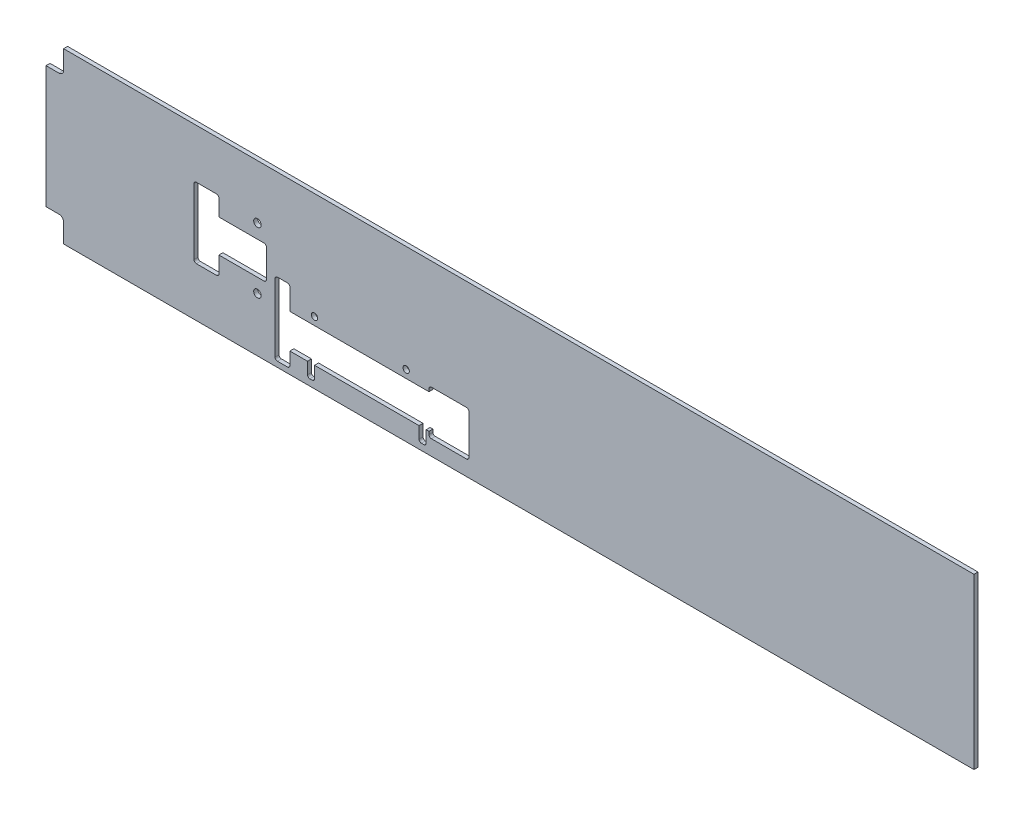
ISO-10303-21;
HEADER;
FILE_DESCRIPTION(('STEP AP214'),'2;1');
FILE_NAME('part.step','',(''),(''),'','','');
FILE_SCHEMA(('AUTOMOTIVE_DESIGN { 1 0 10303 214 1 1 1 1 }'));
ENDSEC;
DATA;
#1=APPLICATION_CONTEXT('core data for automotive mechanical design processes');
#2=APPLICATION_PROTOCOL_DEFINITION('international standard','automotive_design',2000,#1);
#3=PRODUCT_CONTEXT('',#1,'mechanical');
#4=PRODUCT('Part','Part','',(#3));
#5=PRODUCT_RELATED_PRODUCT_CATEGORY('part','',(#4));
#6=PRODUCT_DEFINITION_FORMATION('','',#4);
#7=PRODUCT_DEFINITION_CONTEXT('part definition',#1,'design');
#8=PRODUCT_DEFINITION('design','',#6,#7);
#9=PRODUCT_DEFINITION_SHAPE('','',#8);
#10=(LENGTH_UNIT() NAMED_UNIT(*) SI_UNIT(.MILLI.,.METRE.));
#11=(NAMED_UNIT(*) PLANE_ANGLE_UNIT() SI_UNIT($,.RADIAN.));
#12=(NAMED_UNIT(*) SI_UNIT($,.STERADIAN.) SOLID_ANGLE_UNIT());
#13=UNCERTAINTY_MEASURE_WITH_UNIT(LENGTH_MEASURE(1.E-05),#10,'distance_accuracy_value','');
#14=(GEOMETRIC_REPRESENTATION_CONTEXT(3) GLOBAL_UNCERTAINTY_ASSIGNED_CONTEXT((#13)) GLOBAL_UNIT_ASSIGNED_CONTEXT((#10,
#11,#12)) REPRESENTATION_CONTEXT('',''));
#15=CARTESIAN_POINT('',(0.,0.,0.));
#16=DIRECTION('',(0.,0.,1.));
#17=DIRECTION('',(1.,0.,0.));
#18=AXIS2_PLACEMENT_3D('',#15,#16,#17);
#19=CARTESIAN_POINT('',(-197.5,-26.,1.7));
#20=DIRECTION('',(0.,1.,0.));
#21=DIRECTION('',(0.,0.,1.));
#22=AXIS2_PLACEMENT_3D('',#19,#20,#21);
#23=PLANE('',#22);
#24=DIRECTION('',(1.,0.,0.));
#25=VECTOR('',#24,1.);
#26=CARTESIAN_POINT('',(-197.5,-26.,0.));
#27=LINE('',#26,#25);
#28=CARTESIAN_POINT('',(-197.5,-26.,0.));
#29=VERTEX_POINT('',#28);
#30=CARTESIAN_POINT('',(-192.,-26.,0.));
#31=VERTEX_POINT('',#30);
#32=EDGE_CURVE('E737',#29,#31,#27,.T.);
#33=ORIENTED_EDGE('',*,*,#32,.T.);
#34=DIRECTION('',(0.,0.,-1.));
#35=VECTOR('',#34,1.);
#36=CARTESIAN_POINT('',(-192.,-26.,1.7));
#37=LINE('',#36,#35);
#38=CARTESIAN_POINT('',(-192.,-26.,1.7));
#39=VERTEX_POINT('',#38);
#40=EDGE_CURVE('E11',#39,#31,#37,.T.);
#41=ORIENTED_EDGE('',*,*,#40,.F.);
#42=DIRECTION('',(1.,0.,0.));
#43=VECTOR('',#42,1.);
#44=CARTESIAN_POINT('',(-197.5,-26.,1.7));
#45=LINE('',#44,#43);
#46=CARTESIAN_POINT('',(-197.5,-26.,1.7));
#47=VERTEX_POINT('',#46);
#48=EDGE_CURVE('E784',#47,#39,#45,.T.);
#49=ORIENTED_EDGE('',*,*,#48,.F.);
#50=DIRECTION('',(0.,0.,-1.));
#51=VECTOR('',#50,1.);
#52=CARTESIAN_POINT('',(-197.5,-26.,1.7));
#53=LINE('',#52,#51);
#54=EDGE_CURVE('E805',#47,#29,#53,.T.);
#55=ORIENTED_EDGE('',*,*,#54,.T.);
#56=EDGE_LOOP('',(#33,#41,#49,#55));
#57=FACE_BOUND('',#56,.T.);
#58=ADVANCED_FACE('F26',(#57),#23,.F.);
#59=CARTESIAN_POINT('',(-192.,-28.,1.7));
#60=DIRECTION('',(0.,0.,-1.));
#61=DIRECTION('',(-1.,0.,0.));
#62=AXIS2_PLACEMENT_3D('',#59,#60,#61);
#63=CYLINDRICAL_SURFACE('',#62,2.);
#64=CARTESIAN_POINT('',(-192.,-28.,0.));
#65=DIRECTION('',(0.,0.,-1.));
#66=DIRECTION('',(-1.,0.,0.));
#67=AXIS2_PLACEMENT_3D('',#64,#65,#66);
#68=CIRCLE('',#67,2.);
#69=CARTESIAN_POINT('',(-190.,-28.,0.));
#70=VERTEX_POINT('',#69);
#71=EDGE_CURVE('E766',#31,#70,#68,.T.);
#72=ORIENTED_EDGE('',*,*,#71,.T.);
#73=DIRECTION('',(0.,0.,-1.));
#74=VECTOR('',#73,1.);
#75=CARTESIAN_POINT('',(-190.,-28.,1.7));
#76=LINE('',#75,#74);
#77=CARTESIAN_POINT('',(-190.,-28.,1.7));
#78=VERTEX_POINT('',#77);
#79=EDGE_CURVE('E33',#78,#70,#76,.T.);
#80=ORIENTED_EDGE('',*,*,#79,.F.);
#81=CARTESIAN_POINT('',(-192.,-28.,1.7));
#82=DIRECTION('',(0.,0.,-1.));
#83=DIRECTION('',(-1.,0.,0.));
#84=AXIS2_PLACEMENT_3D('',#81,#82,#83);
#85=CIRCLE('',#84,2.);
#86=EDGE_CURVE('E787',#39,#78,#85,.T.);
#87=ORIENTED_EDGE('',*,*,#86,.F.);
#88=ORIENTED_EDGE('',*,*,#40,.T.);
#89=EDGE_LOOP('',(#72,#80,#87,#88));
#90=FACE_BOUND('',#89,.T.);
#91=ADVANCED_FACE('F855',(#90),#63,.F.);
#92=CARTESIAN_POINT('',(-190.,-28.,1.7));
#93=DIRECTION('',(1.,0.,0.));
#94=DIRECTION('',(0.,0.,-1.));
#95=AXIS2_PLACEMENT_3D('',#92,#93,#94);
#96=PLANE('',#95);
#97=DIRECTION('',(0.,-1.,0.));
#98=VECTOR('',#97,1.);
#99=CARTESIAN_POINT('',(-190.,-28.,0.));
#100=LINE('',#99,#98);
#101=CARTESIAN_POINT('',(-190.,-36.,0.));
#102=VERTEX_POINT('',#101);
#103=EDGE_CURVE('E768',#70,#102,#100,.T.);
#104=ORIENTED_EDGE('',*,*,#103,.T.);
#105=DIRECTION('',(0.,0.,-1.));
#106=VECTOR('',#105,1.);
#107=CARTESIAN_POINT('',(-190.,-36.,1.7));
#108=LINE('',#107,#106);
#109=CARTESIAN_POINT('',(-190.,-36.,1.7));
#110=VERTEX_POINT('',#109);
#111=EDGE_CURVE('E826',#110,#102,#108,.T.);
#112=ORIENTED_EDGE('',*,*,#111,.F.);
#113=DIRECTION('',(0.,-1.,0.));
#114=VECTOR('',#113,1.);
#115=CARTESIAN_POINT('',(-190.,-28.,1.7));
#116=LINE('',#115,#114);
#117=EDGE_CURVE('E789',#78,#110,#116,.T.);
#118=ORIENTED_EDGE('',*,*,#117,.F.);
#119=ORIENTED_EDGE('',*,*,#79,.T.);
#120=EDGE_LOOP('',(#104,#112,#118,#119));
#121=FACE_BOUND('',#120,.T.);
#122=ADVANCED_FACE('F833',(#121),#96,.F.);
#123=CARTESIAN_POINT('',(-190.,-36.,1.7));
#124=DIRECTION('',(0.,1.,0.));
#125=DIRECTION('',(0.,0.,1.));
#126=AXIS2_PLACEMENT_3D('',#123,#124,#125);
#127=PLANE('',#126);
#128=DIRECTION('',(1.,0.,0.));
#129=VECTOR('',#128,1.);
#130=CARTESIAN_POINT('',(-190.,-36.,0.));
#131=LINE('',#130,#129);
#132=CARTESIAN_POINT('',(197.5,-36.,0.));
#133=VERTEX_POINT('',#132);
#134=EDGE_CURVE('E770',#102,#133,#131,.T.);
#135=ORIENTED_EDGE('',*,*,#134,.T.);
#136=DIRECTION('',(0.,0.,-1.));
#137=VECTOR('',#136,1.);
#138=CARTESIAN_POINT('',(197.5,-36.,1.7));
#139=LINE('',#138,#137);
#140=CARTESIAN_POINT('',(197.5,-36.,1.7));
#141=VERTEX_POINT('',#140);
#142=EDGE_CURVE('E823',#141,#133,#139,.T.);
#143=ORIENTED_EDGE('',*,*,#142,.F.);
#144=DIRECTION('',(1.,0.,0.));
#145=VECTOR('',#144,1.);
#146=CARTESIAN_POINT('',(-190.,-36.,1.7));
#147=LINE('',#146,#145);
#148=EDGE_CURVE('E791',#110,#141,#147,.T.);
#149=ORIENTED_EDGE('',*,*,#148,.F.);
#150=ORIENTED_EDGE('',*,*,#111,.T.);
#151=EDGE_LOOP('',(#135,#143,#149,#150));
#152=FACE_BOUND('',#151,.T.);
#153=ADVANCED_FACE('F844',(#152),#127,.F.);
#154=CARTESIAN_POINT('',(197.5,36.,1.7));
#155=DIRECTION('',(-1.,0.,0.));
#156=DIRECTION('',(0.,0.,1.));
#157=AXIS2_PLACEMENT_3D('',#154,#155,#156);
#158=PLANE('',#157);
#159=DIRECTION('',(0.,1.,0.));
#160=VECTOR('',#159,1.);
#161=CARTESIAN_POINT('',(197.5,36.,0.));
#162=LINE('',#161,#160);
#163=CARTESIAN_POINT('',(197.5,36.,0.));
#164=VERTEX_POINT('',#163);
#165=EDGE_CURVE('E772',#133,#164,#162,.T.);
#166=ORIENTED_EDGE('',*,*,#165,.T.);
#167=DIRECTION('',(0.,0.,-1.));
#168=VECTOR('',#167,1.);
#169=CARTESIAN_POINT('',(197.5,36.,1.7));
#170=LINE('',#169,#168);
#171=CARTESIAN_POINT('',(197.5,36.,1.7));
#172=VERTEX_POINT('',#171);
#173=EDGE_CURVE('E820',#172,#164,#170,.T.);
#174=ORIENTED_EDGE('',*,*,#173,.F.);
#175=DIRECTION('',(0.,1.,0.));
#176=VECTOR('',#175,1.);
#177=CARTESIAN_POINT('',(197.5,36.,1.7));
#178=LINE('',#177,#176);
#179=EDGE_CURVE('E793',#141,#172,#178,.T.);
#180=ORIENTED_EDGE('',*,*,#179,.F.);
#181=ORIENTED_EDGE('',*,*,#142,.T.);
#182=EDGE_LOOP('',(#166,#174,#180,#181));
#183=FACE_BOUND('',#182,.T.);
#184=ADVANCED_FACE('F848',(#183),#158,.F.);
#185=CARTESIAN_POINT('',(-190.,35.9999999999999,1.7));
#186=DIRECTION('',(0.,-1.,0.));
#187=DIRECTION('',(1.,0.,0.));
#188=AXIS2_PLACEMENT_3D('',#185,#186,#187);
#189=PLANE('',#188);
#190=DIRECTION('',(-1.,0.,0.));
#191=VECTOR('',#190,1.);
#192=CARTESIAN_POINT('',(-190.,35.9999999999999,0.));
#193=LINE('',#192,#191);
#194=CARTESIAN_POINT('',(-190.,35.9999999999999,0.));
#195=VERTEX_POINT('',#194);
#196=EDGE_CURVE('E774',#164,#195,#193,.T.);
#197=ORIENTED_EDGE('',*,*,#196,.T.);
#198=DIRECTION('',(0.,0.,-1.));
#199=VECTOR('',#198,1.);
#200=CARTESIAN_POINT('',(-190.,35.9999999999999,1.7));
#201=LINE('',#200,#199);
#202=CARTESIAN_POINT('',(-190.,35.9999999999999,1.7));
#203=VERTEX_POINT('',#202);
#204=EDGE_CURVE('E817',#203,#195,#201,.T.);
#205=ORIENTED_EDGE('',*,*,#204,.F.);
#206=DIRECTION('',(-1.,0.,0.));
#207=VECTOR('',#206,1.);
#208=CARTESIAN_POINT('',(-190.,35.9999999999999,1.7));
#209=LINE('',#208,#207);
#210=EDGE_CURVE('E795',#172,#203,#209,.T.);
#211=ORIENTED_EDGE('',*,*,#210,.F.);
#212=ORIENTED_EDGE('',*,*,#173,.T.);
#213=EDGE_LOOP('',(#197,#205,#211,#212));
#214=FACE_BOUND('',#213,.T.);
#215=ADVANCED_FACE('F878',(#214),#189,.F.);
#216=CARTESIAN_POINT('',(-190.,27.9999999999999,1.7));
#217=DIRECTION('',(1.,0.,0.));
#218=DIRECTION('',(0.,0.,-1.));
#219=AXIS2_PLACEMENT_3D('',#216,#217,#218);
#220=PLANE('',#219);
#221=DIRECTION('',(0.,-1.,0.));
#222=VECTOR('',#221,1.);
#223=CARTESIAN_POINT('',(-190.,27.9999999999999,0.));
#224=LINE('',#223,#222);
#225=CARTESIAN_POINT('',(-190.,27.9999999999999,0.));
#226=VERTEX_POINT('',#225);
#227=EDGE_CURVE('E776',#195,#226,#224,.T.);
#228=ORIENTED_EDGE('',*,*,#227,.T.);
#229=DIRECTION('',(0.,0.,-1.));
#230=VECTOR('',#229,1.);
#231=CARTESIAN_POINT('',(-190.,27.9999999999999,1.7));
#232=LINE('',#231,#230);
#233=CARTESIAN_POINT('',(-190.,27.9999999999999,1.7));
#234=VERTEX_POINT('',#233);
#235=EDGE_CURVE('E814',#234,#226,#232,.T.);
#236=ORIENTED_EDGE('',*,*,#235,.F.);
#237=DIRECTION('',(0.,-1.,0.));
#238=VECTOR('',#237,1.);
#239=CARTESIAN_POINT('',(-190.,27.9999999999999,1.7));
#240=LINE('',#239,#238);
#241=EDGE_CURVE('E797',#203,#234,#240,.T.);
#242=ORIENTED_EDGE('',*,*,#241,.F.);
#243=ORIENTED_EDGE('',*,*,#204,.T.);
#244=EDGE_LOOP('',(#228,#236,#242,#243));
#245=FACE_BOUND('',#244,.T.);
#246=ADVANCED_FACE('F875',(#245),#220,.F.);
#247=CARTESIAN_POINT('',(-192.,27.9999999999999,1.7));
#248=DIRECTION('',(0.,0.,-1.));
#249=DIRECTION('',(-1.,0.,0.));
#250=AXIS2_PLACEMENT_3D('',#247,#248,#249);
#251=CYLINDRICAL_SURFACE('',#250,2.);
#252=CARTESIAN_POINT('',(-192.,27.9999999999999,0.));
#253=DIRECTION('',(0.,0.,-1.));
#254=DIRECTION('',(1.,0.,0.));
#255=AXIS2_PLACEMENT_3D('',#252,#253,#254);
#256=CIRCLE('',#255,2.);
#257=CARTESIAN_POINT('',(-192.,25.9999999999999,0.));
#258=VERTEX_POINT('',#257);
#259=EDGE_CURVE('E778',#226,#258,#256,.T.);
#260=ORIENTED_EDGE('',*,*,#259,.T.);
#261=DIRECTION('',(0.,0.,-1.));
#262=VECTOR('',#261,1.);
#263=CARTESIAN_POINT('',(-192.,25.9999999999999,1.7));
#264=LINE('',#263,#262);
#265=CARTESIAN_POINT('',(-192.,25.9999999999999,1.7));
#266=VERTEX_POINT('',#265);
#267=EDGE_CURVE('E811',#266,#258,#264,.T.);
#268=ORIENTED_EDGE('',*,*,#267,.F.);
#269=CARTESIAN_POINT('',(-192.,27.9999999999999,1.7));
#270=DIRECTION('',(0.,0.,-1.));
#271=DIRECTION('',(1.,0.,0.));
#272=AXIS2_PLACEMENT_3D('',#269,#270,#271);
#273=CIRCLE('',#272,2.);
#274=EDGE_CURVE('E799',#234,#266,#273,.T.);
#275=ORIENTED_EDGE('',*,*,#274,.F.);
#276=ORIENTED_EDGE('',*,*,#235,.T.);
#277=EDGE_LOOP('',(#260,#268,#275,#276));
#278=FACE_BOUND('',#277,.T.);
#279=ADVANCED_FACE('F871',(#278),#251,.F.);
#280=CARTESIAN_POINT('',(-197.5,25.9999999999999,1.7));
#281=DIRECTION('',(0.,-1.,0.));
#282=DIRECTION('',(0.,0.,-1.));
#283=AXIS2_PLACEMENT_3D('',#280,#281,#282);
#284=PLANE('',#283);
#285=DIRECTION('',(-1.,0.,0.));
#286=VECTOR('',#285,1.);
#287=CARTESIAN_POINT('',(-197.5,25.9999999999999,0.));
#288=LINE('',#287,#286);
#289=CARTESIAN_POINT('',(-197.5,25.9999999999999,0.));
#290=VERTEX_POINT('',#289);
#291=EDGE_CURVE('E780',#258,#290,#288,.T.);
#292=ORIENTED_EDGE('',*,*,#291,.T.);
#293=DIRECTION('',(0.,0.,-1.));
#294=VECTOR('',#293,1.);
#295=CARTESIAN_POINT('',(-197.5,25.9999999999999,1.7));
#296=LINE('',#295,#294);
#297=CARTESIAN_POINT('',(-197.5,25.9999999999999,1.7));
#298=VERTEX_POINT('',#297);
#299=EDGE_CURVE('E808',#298,#290,#296,.T.);
#300=ORIENTED_EDGE('',*,*,#299,.F.);
#301=DIRECTION('',(-1.,0.,0.));
#302=VECTOR('',#301,1.);
#303=CARTESIAN_POINT('',(-197.5,25.9999999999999,1.7));
#304=LINE('',#303,#302);
#305=EDGE_CURVE('E801',#266,#298,#304,.T.);
#306=ORIENTED_EDGE('',*,*,#305,.F.);
#307=ORIENTED_EDGE('',*,*,#267,.T.);
#308=EDGE_LOOP('',(#292,#300,#306,#307));
#309=FACE_BOUND('',#308,.T.);
#310=ADVANCED_FACE('F867',(#309),#284,.F.);
#311=CARTESIAN_POINT('',(-197.5,25.9999999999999,1.7));
#312=DIRECTION('',(1.,0.,0.));
#313=DIRECTION('',(0.,0.,-1.));
#314=AXIS2_PLACEMENT_3D('',#311,#312,#313);
#315=PLANE('',#314);
#316=DIRECTION('',(0.,-1.,0.));
#317=VECTOR('',#316,1.);
#318=CARTESIAN_POINT('',(-197.5,25.9999999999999,0.));
#319=LINE('',#318,#317);
#320=EDGE_CURVE('E782',#290,#29,#319,.T.);
#321=ORIENTED_EDGE('',*,*,#320,.T.);
#322=ORIENTED_EDGE('',*,*,#54,.F.);
#323=DIRECTION('',(0.,-1.,0.));
#324=VECTOR('',#323,1.);
#325=CARTESIAN_POINT('',(-197.5,25.9999999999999,1.7));
#326=LINE('',#325,#324);
#327=EDGE_CURVE('E803',#298,#47,#326,.T.);
#328=ORIENTED_EDGE('',*,*,#327,.F.);
#329=ORIENTED_EDGE('',*,*,#299,.T.);
#330=EDGE_LOOP('',(#321,#322,#328,#329));
#331=FACE_BOUND('',#330,.T.);
#332=ADVANCED_FACE('F862',(#331),#315,.F.);
#333=CARTESIAN_POINT('',(-192.,-28.,1.7));
#334=DIRECTION('',(0.,0.,-1.));
#335=DIRECTION('',(-1.,0.,0.));
#336=AXIS2_PLACEMENT_3D('',#333,#334,#335);
#337=PLANE('',#336);
#338=CARTESIAN_POINT('',(-83.2,-9.34999999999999,1.7));
#339=DIRECTION('',(0.,0.,1.));
#340=DIRECTION('',(1.,0.,0.));
#341=AXIS2_PLACEMENT_3D('',#338,#339,#340);
#342=CIRCLE('',#341,1.35000000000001);
#343=CARTESIAN_POINT('',(-81.85,-9.34999999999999,1.7));
#344=VERTEX_POINT('',#343);
#345=EDGE_CURVE('E1346',#344,#344,#342,.T.);
#346=ORIENTED_EDGE('',*,*,#345,.F.);
#347=EDGE_LOOP('',(#346));
#348=FACE_BOUND('',#347,.T.);
#349=CARTESIAN_POINT('',(-44.2,-9.34999999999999,1.7));
#350=DIRECTION('',(0.,0.,1.));
#351=DIRECTION('',(1.,0.,0.));
#352=AXIS2_PLACEMENT_3D('',#349,#350,#351);
#353=CIRCLE('',#352,1.35);
#354=CARTESIAN_POINT('',(-42.85,-9.34999999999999,1.7));
#355=VERTEX_POINT('',#354);
#356=EDGE_CURVE('E1348',#355,#355,#353,.T.);
#357=ORIENTED_EDGE('',*,*,#356,.F.);
#358=EDGE_LOOP('',(#357));
#359=FACE_BOUND('',#358,.T.);
#360=CARTESIAN_POINT('',(-94.7,-3.7,1.7));
#361=DIRECTION('',(0.,0.,1.));
#362=DIRECTION('',(1.,0.,0.));
#363=AXIS2_PLACEMENT_3D('',#360,#361,#362);
#364=CIRCLE('',#363,1.);
#365=CARTESIAN_POINT('',(-93.7,-3.70000000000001,1.7));
#366=VERTEX_POINT('',#365);
#367=CARTESIAN_POINT('',(-94.7,-2.7,1.7));
#368=VERTEX_POINT('',#367);
#369=EDGE_CURVE('E389',#366,#368,#364,.T.);
#370=ORIENTED_EDGE('',*,*,#369,.F.);
#371=DIRECTION('',(0.,1.,0.));
#372=VECTOR('',#371,1.);
#373=CARTESIAN_POINT('',(-93.7,-12.7,1.7));
#374=LINE('',#373,#372);
#375=CARTESIAN_POINT('',(-93.7,-12.7,1.7));
#376=VERTEX_POINT('',#375);
#377=EDGE_CURVE('E40',#376,#366,#374,.T.);
#378=ORIENTED_EDGE('',*,*,#377,.F.);
#379=DIRECTION('',(-1.,0.,0.));
#380=VECTOR('',#379,1.);
#381=CARTESIAN_POINT('',(-93.7,-12.7,1.7));
#382=LINE('',#381,#380);
#383=CARTESIAN_POINT('',(-34.5,-12.7,1.7));
#384=VERTEX_POINT('',#383);
#385=EDGE_CURVE('E483',#384,#376,#382,.T.);
#386=ORIENTED_EDGE('',*,*,#385,.F.);
#387=DIRECTION('',(0.,-1.,0.));
#388=VECTOR('',#387,1.);
#389=CARTESIAN_POINT('',(-34.5,-11.5,1.7));
#390=LINE('',#389,#388);
#391=CARTESIAN_POINT('',(-34.5,-11.5,1.7));
#392=VERTEX_POINT('',#391);
#393=EDGE_CURVE('E480',#392,#384,#390,.T.);
#394=ORIENTED_EDGE('',*,*,#393,.F.);
#395=CARTESIAN_POINT('',(-33.5,-11.5,1.7));
#396=DIRECTION('',(0.,0.,1.));
#397=DIRECTION('',(1.,0.,0.));
#398=AXIS2_PLACEMENT_3D('',#395,#396,#397);
#399=CIRCLE('',#398,1.);
#400=CARTESIAN_POINT('',(-33.5,-10.5,1.7));
#401=VERTEX_POINT('',#400);
#402=EDGE_CURVE('E477',#401,#392,#399,.T.);
#403=ORIENTED_EDGE('',*,*,#402,.F.);
#404=DIRECTION('',(-1.,0.,0.));
#405=VECTOR('',#404,1.);
#406=CARTESIAN_POINT('',(-33.5,-10.5,1.7));
#407=LINE('',#406,#405);
#408=CARTESIAN_POINT('',(-18.5,-10.5,1.7));
#409=VERTEX_POINT('',#408);
#410=EDGE_CURVE('E474',#409,#401,#407,.T.);
#411=ORIENTED_EDGE('',*,*,#410,.F.);
#412=CARTESIAN_POINT('',(-18.5,-11.5,1.7));
#413=DIRECTION('',(0.,0.,1.));
#414=DIRECTION('',(1.,0.,0.));
#415=AXIS2_PLACEMENT_3D('',#412,#413,#414);
#416=CIRCLE('',#415,1.);
#417=CARTESIAN_POINT('',(-17.5,-11.5,1.7));
#418=VERTEX_POINT('',#417);
#419=EDGE_CURVE('E471',#418,#409,#416,.T.);
#420=ORIENTED_EDGE('',*,*,#419,.F.);
#421=DIRECTION('',(0.,1.,0.));
#422=VECTOR('',#421,1.);
#423=CARTESIAN_POINT('',(-17.5,-11.5,1.7));
#424=LINE('',#423,#422);
#425=CARTESIAN_POINT('',(-17.5,-28.5,1.7));
#426=VERTEX_POINT('',#425);
#427=EDGE_CURVE('E468',#426,#418,#424,.T.);
#428=ORIENTED_EDGE('',*,*,#427,.F.);
#429=CARTESIAN_POINT('',(-18.5,-28.5,1.7));
#430=DIRECTION('',(0.,0.,1.));
#431=DIRECTION('',(1.,0.,0.));
#432=AXIS2_PLACEMENT_3D('',#429,#430,#431);
#433=CIRCLE('',#432,1.);
#434=CARTESIAN_POINT('',(-18.5,-29.5,1.7));
#435=VERTEX_POINT('',#434);
#436=EDGE_CURVE('E465',#435,#426,#433,.T.);
#437=ORIENTED_EDGE('',*,*,#436,.F.);
#438=DIRECTION('',(1.,0.,0.));
#439=VECTOR('',#438,1.);
#440=CARTESIAN_POINT('',(-33.5,-29.5,1.7));
#441=LINE('',#440,#439);
#442=CARTESIAN_POINT('',(-33.5,-29.5,1.7));
#443=VERTEX_POINT('',#442);
#444=EDGE_CURVE('E462',#443,#435,#441,.T.);
#445=ORIENTED_EDGE('',*,*,#444,.F.);
#446=CARTESIAN_POINT('',(-33.5,-28.5,1.7));
#447=DIRECTION('',(0.,0.,1.));
#448=DIRECTION('',(1.,0.,0.));
#449=AXIS2_PLACEMENT_3D('',#446,#447,#448);
#450=CIRCLE('',#449,1.);
#451=CARTESIAN_POINT('',(-34.5,-28.5,1.7));
#452=VERTEX_POINT('',#451);
#453=EDGE_CURVE('E459',#452,#443,#450,.T.);
#454=ORIENTED_EDGE('',*,*,#453,.F.);
#455=DIRECTION('',(0.,-1.,0.));
#456=VECTOR('',#455,1.);
#457=CARTESIAN_POINT('',(-34.5,-27.3,1.7));
#458=LINE('',#457,#456);
#459=CARTESIAN_POINT('',(-34.5,-27.3,1.7));
#460=VERTEX_POINT('',#459);
#461=EDGE_CURVE('E456',#460,#452,#458,.T.);
#462=ORIENTED_EDGE('',*,*,#461,.F.);
#463=DIRECTION('',(1.,0.,0.));
#464=VECTOR('',#463,1.);
#465=CARTESIAN_POINT('',(-35.7,-27.3,1.7));
#466=LINE('',#465,#464);
#467=CARTESIAN_POINT('',(-35.7,-27.3,1.7));
#468=VERTEX_POINT('',#467);
#469=EDGE_CURVE('E453',#468,#460,#466,.T.);
#470=ORIENTED_EDGE('',*,*,#469,.F.);
#471=DIRECTION('',(0.,1.,0.));
#472=VECTOR('',#471,1.);
#473=CARTESIAN_POINT('',(-35.7,-27.3,1.7));
#474=LINE('',#473,#472);
#475=CARTESIAN_POINT('',(-35.7,-32.3,1.7));
#476=VERTEX_POINT('',#475);
#477=EDGE_CURVE('E450',#476,#468,#474,.T.);
#478=ORIENTED_EDGE('',*,*,#477,.F.);
#479=CARTESIAN_POINT('',(-36.7,-32.3,1.7));
#480=DIRECTION('',(0.,0.,1.));
#481=DIRECTION('',(1.,0.,0.));
#482=AXIS2_PLACEMENT_3D('',#479,#480,#481);
#483=CIRCLE('',#482,1.);
#484=CARTESIAN_POINT('',(-36.7,-33.3,1.7));
#485=VERTEX_POINT('',#484);
#486=EDGE_CURVE('E447',#485,#476,#483,.T.);
#487=ORIENTED_EDGE('',*,*,#486,.F.);
#488=DIRECTION('',(1.,0.,0.));
#489=VECTOR('',#488,1.);
#490=CARTESIAN_POINT('',(-37.7,-33.3,1.7));
#491=LINE('',#490,#489);
#492=CARTESIAN_POINT('',(-37.7,-33.3,1.7));
#493=VERTEX_POINT('',#492);
#494=EDGE_CURVE('E444',#493,#485,#491,.T.);
#495=ORIENTED_EDGE('',*,*,#494,.F.);
#496=CARTESIAN_POINT('',(-37.7,-32.3,1.7));
#497=DIRECTION('',(0.,0.,1.));
#498=DIRECTION('',(1.,0.,0.));
#499=AXIS2_PLACEMENT_3D('',#496,#497,#498);
#500=CIRCLE('',#499,1.);
#501=CARTESIAN_POINT('',(-38.7,-32.3,1.7));
#502=VERTEX_POINT('',#501);
#503=EDGE_CURVE('E441',#502,#493,#500,.T.);
#504=ORIENTED_EDGE('',*,*,#503,.F.);
#505=DIRECTION('',(0.,-1.,0.));
#506=VECTOR('',#505,1.);
#507=CARTESIAN_POINT('',(-38.7,-27.3,1.7));
#508=LINE('',#507,#506);
#509=CARTESIAN_POINT('',(-38.7,-27.3,1.7));
#510=VERTEX_POINT('',#509);
#511=EDGE_CURVE('E438',#510,#502,#508,.T.);
#512=ORIENTED_EDGE('',*,*,#511,.F.);
#513=DIRECTION('',(1.,0.,0.));
#514=VECTOR('',#513,1.);
#515=CARTESIAN_POINT('',(-83.2,-27.3,1.7));
#516=LINE('',#515,#514);
#517=CARTESIAN_POINT('',(-83.2,-27.3,1.7));
#518=VERTEX_POINT('',#517);
#519=EDGE_CURVE('E435',#518,#510,#516,.T.);
#520=ORIENTED_EDGE('',*,*,#519,.F.);
#521=DIRECTION('',(0.,1.,0.));
#522=VECTOR('',#521,1.);
#523=CARTESIAN_POINT('',(-83.2,-27.3,1.7));
#524=LINE('',#523,#522);
#525=CARTESIAN_POINT('',(-83.2,-32.3,1.7));
#526=VERTEX_POINT('',#525);
#527=EDGE_CURVE('E432',#526,#518,#524,.T.);
#528=ORIENTED_EDGE('',*,*,#527,.F.);
#529=CARTESIAN_POINT('',(-84.2,-32.3,1.7));
#530=DIRECTION('',(0.,0.,1.));
#531=DIRECTION('',(1.,0.,0.));
#532=AXIS2_PLACEMENT_3D('',#529,#530,#531);
#533=CIRCLE('',#532,1.);
#534=CARTESIAN_POINT('',(-84.2,-33.3,1.7));
#535=VERTEX_POINT('',#534);
#536=EDGE_CURVE('E429',#535,#526,#533,.T.);
#537=ORIENTED_EDGE('',*,*,#536,.F.);
#538=DIRECTION('',(1.,0.,0.));
#539=VECTOR('',#538,1.);
#540=CARTESIAN_POINT('',(-85.2,-33.3,1.7));
#541=LINE('',#540,#539);
#542=CARTESIAN_POINT('',(-85.2,-33.3,1.7));
#543=VERTEX_POINT('',#542);
#544=EDGE_CURVE('E426',#543,#535,#541,.T.);
#545=ORIENTED_EDGE('',*,*,#544,.F.);
#546=CARTESIAN_POINT('',(-85.2,-32.3,1.7));
#547=DIRECTION('',(0.,0.,1.));
#548=DIRECTION('',(1.,0.,0.));
#549=AXIS2_PLACEMENT_3D('',#546,#547,#548);
#550=CIRCLE('',#549,0.999999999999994);
#551=CARTESIAN_POINT('',(-86.2,-32.3,1.7));
#552=VERTEX_POINT('',#551);
#553=EDGE_CURVE('E423',#552,#543,#550,.T.);
#554=ORIENTED_EDGE('',*,*,#553,.F.);
#555=DIRECTION('',(0.,-1.,0.));
#556=VECTOR('',#555,1.);
#557=CARTESIAN_POINT('',(-86.2,-27.3,1.7));
#558=LINE('',#557,#556);
#559=CARTESIAN_POINT('',(-86.2,-27.3,1.7));
#560=VERTEX_POINT('',#559);
#561=EDGE_CURVE('E420',#560,#552,#558,.T.);
#562=ORIENTED_EDGE('',*,*,#561,.F.);
#563=DIRECTION('',(1.,0.,0.));
#564=VECTOR('',#563,1.);
#565=CARTESIAN_POINT('',(-93.7,-27.3,1.7));
#566=LINE('',#565,#564);
#567=CARTESIAN_POINT('',(-93.7,-27.3,1.7));
#568=VERTEX_POINT('',#567);
#569=EDGE_CURVE('E417',#568,#560,#566,.T.);
#570=ORIENTED_EDGE('',*,*,#569,.F.);
#571=DIRECTION('',(0.,1.,0.));
#572=VECTOR('',#571,1.);
#573=CARTESIAN_POINT('',(-93.7,-32.7,1.7));
#574=LINE('',#573,#572);
#575=CARTESIAN_POINT('',(-93.7,-32.7,1.7));
#576=VERTEX_POINT('',#575);
#577=EDGE_CURVE('E414',#576,#568,#574,.T.);
#578=ORIENTED_EDGE('',*,*,#577,.F.);
#579=CARTESIAN_POINT('',(-94.7,-32.7,1.7));
#580=DIRECTION('',(0.,0.,1.));
#581=DIRECTION('',(1.,0.,0.));
#582=AXIS2_PLACEMENT_3D('',#579,#580,#581);
#583=CIRCLE('',#582,1.);
#584=CARTESIAN_POINT('',(-94.7,-33.7,1.7));
#585=VERTEX_POINT('',#584);
#586=EDGE_CURVE('E411',#585,#576,#583,.T.);
#587=ORIENTED_EDGE('',*,*,#586,.F.);
#588=DIRECTION('',(1.,0.,0.));
#589=VECTOR('',#588,1.);
#590=CARTESIAN_POINT('',(-94.7,-33.7,1.7));
#591=LINE('',#590,#589);
#592=CARTESIAN_POINT('',(-99.,-33.7,1.7));
#593=VERTEX_POINT('',#592);
#594=EDGE_CURVE('E408',#593,#585,#591,.T.);
#595=ORIENTED_EDGE('',*,*,#594,.F.);
#596=CARTESIAN_POINT('',(-99.,-32.7,1.7));
#597=DIRECTION('',(0.,0.,1.));
#598=DIRECTION('',(1.,0.,0.));
#599=AXIS2_PLACEMENT_3D('',#596,#597,#598);
#600=CIRCLE('',#599,1.);
#601=CARTESIAN_POINT('',(-100.,-32.7,1.7));
#602=VERTEX_POINT('',#601);
#603=EDGE_CURVE('E405',#602,#593,#600,.T.);
#604=ORIENTED_EDGE('',*,*,#603,.F.);
#605=DIRECTION('',(0.,-1.,0.));
#606=VECTOR('',#605,1.);
#607=CARTESIAN_POINT('',(-100.,-32.7,1.7));
#608=LINE('',#607,#606);
#609=CARTESIAN_POINT('',(-100.,-3.70000000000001,1.7));
#610=VERTEX_POINT('',#609);
#611=EDGE_CURVE('E399',#610,#602,#608,.T.);
#612=ORIENTED_EDGE('',*,*,#611,.F.);
#613=CARTESIAN_POINT('',(-99.,-3.7,1.7));
#614=DIRECTION('',(0.,0.,1.));
#615=DIRECTION('',(1.,0.,0.));
#616=AXIS2_PLACEMENT_3D('',#613,#614,#615);
#617=CIRCLE('',#616,1.);
#618=CARTESIAN_POINT('',(-99.,-2.7,1.7));
#619=VERTEX_POINT('',#618);
#620=EDGE_CURVE('E397',#619,#610,#617,.T.);
#621=ORIENTED_EDGE('',*,*,#620,.F.);
#622=DIRECTION('',(-1.,0.,0.));
#623=VECTOR('',#622,1.);
#624=CARTESIAN_POINT('',(-94.7,-2.7,1.7));
#625=LINE('',#624,#623);
#626=EDGE_CURVE('E380',#368,#619,#625,.T.);
#627=ORIENTED_EDGE('',*,*,#626,.F.);
#628=EDGE_LOOP('',(#370,#378,#386,#394,#403,#411,#420,#428,#437,#445,#454,#462,#470,#478,#487,
#495,#504,#512,#520,#528,#537,#545,#554,#562,#570,#578,#587,#595,#604,#612,#621,#627));
#629=FACE_BOUND('',#628,.T.);
#630=CARTESIAN_POINT('',(-107.5,-13.,1.7));
#631=DIRECTION('',(0.,0.,1.));
#632=DIRECTION('',(-1.,0.,0.));
#633=AXIS2_PLACEMENT_3D('',#630,#631,#632);
#634=CIRCLE('',#633,1.6);
#635=CARTESIAN_POINT('',(-109.1,-13.,1.7));
#636=VERTEX_POINT('',#635);
#637=EDGE_CURVE('E581',#636,#636,#634,.T.);
#638=ORIENTED_EDGE('',*,*,#637,.F.);
#639=EDGE_LOOP('',(#638));
#640=FACE_BOUND('',#639,.T.);
#641=CARTESIAN_POINT('',(-107.5,13.,1.7));
#642=DIRECTION('',(0.,0.,1.));
#643=DIRECTION('',(1.,0.,0.));
#644=AXIS2_PLACEMENT_3D('',#641,#642,#643);
#645=CIRCLE('',#644,1.6);
#646=CARTESIAN_POINT('',(-105.9,13.,1.7));
#647=VERTEX_POINT('',#646);
#648=EDGE_CURVE('E645',#647,#647,#645,.T.);
#649=ORIENTED_EDGE('',*,*,#648,.F.);
#650=EDGE_LOOP('',(#649));
#651=FACE_BOUND('',#650,.T.);
#652=DIRECTION('',(0.,1.,0.));
#653=VECTOR('',#652,1.);
#654=CARTESIAN_POINT('',(-123.9,14.,1.7));
#655=LINE('',#654,#653);
#656=CARTESIAN_POINT('',(-123.9,6.99999999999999,1.7));
#657=VERTEX_POINT('',#656);
#658=CARTESIAN_POINT('',(-123.9,14.,1.7));
#659=VERTEX_POINT('',#658);
#660=EDGE_CURVE('E653',#657,#659,#655,.T.);
#661=ORIENTED_EDGE('',*,*,#660,.F.);
#662=DIRECTION('',(-1.,0.,0.));
#663=VECTOR('',#662,1.);
#664=CARTESIAN_POINT('',(-123.9,6.99999999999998,1.7));
#665=LINE('',#664,#663);
#666=CARTESIAN_POINT('',(-104.7,6.99999999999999,1.7));
#667=VERTEX_POINT('',#666);
#668=EDGE_CURVE('E651',#667,#657,#665,.T.);
#669=ORIENTED_EDGE('',*,*,#668,.F.);
#670=CARTESIAN_POINT('',(-104.7,5.99999999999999,1.7));
#671=DIRECTION('',(0.,0.,1.));
#672=DIRECTION('',(1.,0.,0.));
#673=AXIS2_PLACEMENT_3D('',#670,#671,#672);
#674=CIRCLE('',#673,1.);
#675=CARTESIAN_POINT('',(-103.7,5.99999999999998,1.7));
#676=VERTEX_POINT('',#675);
#677=EDGE_CURVE('E689',#676,#667,#674,.T.);
#678=ORIENTED_EDGE('',*,*,#677,.F.);
#679=DIRECTION('',(0.,1.,0.));
#680=VECTOR('',#679,1.);
#681=CARTESIAN_POINT('',(-103.7,5.99999999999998,1.7));
#682=LINE('',#681,#680);
#683=CARTESIAN_POINT('',(-103.7,-6.00000000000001,1.7));
#684=VERTEX_POINT('',#683);
#685=EDGE_CURVE('E686',#684,#676,#682,.T.);
#686=ORIENTED_EDGE('',*,*,#685,.F.);
#687=CARTESIAN_POINT('',(-104.7,-6.00000000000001,1.7));
#688=DIRECTION('',(0.,0.,1.));
#689=DIRECTION('',(1.,0.,0.));
#690=AXIS2_PLACEMENT_3D('',#687,#688,#689);
#691=CIRCLE('',#690,1.);
#692=CARTESIAN_POINT('',(-104.7,-7.00000000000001,1.7));
#693=VERTEX_POINT('',#692);
#694=EDGE_CURVE('E683',#693,#684,#691,.T.);
#695=ORIENTED_EDGE('',*,*,#694,.F.);
#696=DIRECTION('',(1.,0.,0.));
#697=VECTOR('',#696,1.);
#698=CARTESIAN_POINT('',(-123.9,-7.00000000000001,1.7));
#699=LINE('',#698,#697);
#700=CARTESIAN_POINT('',(-123.9,-7.00000000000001,1.7));
#701=VERTEX_POINT('',#700);
#702=EDGE_CURVE('E680',#701,#693,#699,.T.);
#703=ORIENTED_EDGE('',*,*,#702,.F.);
#704=DIRECTION('',(0.,1.,0.));
#705=VECTOR('',#704,1.);
#706=CARTESIAN_POINT('',(-123.9,-7.00000000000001,1.7));
#707=LINE('',#706,#705);
#708=CARTESIAN_POINT('',(-123.9,-14.,1.7));
#709=VERTEX_POINT('',#708);
#710=EDGE_CURVE('E677',#709,#701,#707,.T.);
#711=ORIENTED_EDGE('',*,*,#710,.F.);
#712=CARTESIAN_POINT('',(-124.9,-14.,1.7));
#713=DIRECTION('',(0.,0.,1.));
#714=DIRECTION('',(1.,0.,0.));
#715=AXIS2_PLACEMENT_3D('',#712,#713,#714);
#716=CIRCLE('',#715,1.);
#717=CARTESIAN_POINT('',(-124.9,-15.,1.7));
#718=VERTEX_POINT('',#717);
#719=EDGE_CURVE('E674',#718,#709,#716,.T.);
#720=ORIENTED_EDGE('',*,*,#719,.F.);
#721=DIRECTION('',(1.,0.,0.));
#722=VECTOR('',#721,1.);
#723=CARTESIAN_POINT('',(-133.5,-15.,1.7));
#724=LINE('',#723,#722);
#725=CARTESIAN_POINT('',(-133.5,-15.,1.7));
#726=VERTEX_POINT('',#725);
#727=EDGE_CURVE('E671',#726,#718,#724,.T.);
#728=ORIENTED_EDGE('',*,*,#727,.F.);
#729=CARTESIAN_POINT('',(-133.5,-14.,1.7));
#730=DIRECTION('',(0.,0.,1.));
#731=DIRECTION('',(1.,0.,0.));
#732=AXIS2_PLACEMENT_3D('',#729,#730,#731);
#733=CIRCLE('',#732,1.);
#734=CARTESIAN_POINT('',(-134.5,-14.,1.7));
#735=VERTEX_POINT('',#734);
#736=EDGE_CURVE('E668',#735,#726,#733,.T.);
#737=ORIENTED_EDGE('',*,*,#736,.F.);
#738=DIRECTION('',(0.,-1.,0.));
#739=VECTOR('',#738,1.);
#740=CARTESIAN_POINT('',(-134.5,14.,1.7));
#741=LINE('',#740,#739);
#742=CARTESIAN_POINT('',(-134.5,14.,1.7));
#743=VERTEX_POINT('',#742);
#744=EDGE_CURVE('E665',#743,#735,#741,.T.);
#745=ORIENTED_EDGE('',*,*,#744,.F.);
#746=CARTESIAN_POINT('',(-133.5,14.,1.7));
#747=DIRECTION('',(0.,0.,1.));
#748=DIRECTION('',(-1.,0.,0.));
#749=AXIS2_PLACEMENT_3D('',#746,#747,#748);
#750=CIRCLE('',#749,1.);
#751=CARTESIAN_POINT('',(-133.5,15.,1.7));
#752=VERTEX_POINT('',#751);
#753=EDGE_CURVE('E662',#752,#743,#750,.T.);
#754=ORIENTED_EDGE('',*,*,#753,.F.);
#755=DIRECTION('',(-1.,0.,0.));
#756=VECTOR('',#755,1.);
#757=CARTESIAN_POINT('',(-133.5,15.,1.7));
#758=LINE('',#757,#756);
#759=CARTESIAN_POINT('',(-124.9,15.,1.7));
#760=VERTEX_POINT('',#759);
#761=EDGE_CURVE('E659',#760,#752,#758,.T.);
#762=ORIENTED_EDGE('',*,*,#761,.F.);
#763=CARTESIAN_POINT('',(-124.9,14.,1.7));
#764=DIRECTION('',(0.,0.,1.));
#765=DIRECTION('',(1.,0.,0.));
#766=AXIS2_PLACEMENT_3D('',#763,#764,#765);
#767=CIRCLE('',#766,1.);
#768=EDGE_CURVE('E656',#659,#760,#767,.T.);
#769=ORIENTED_EDGE('',*,*,#768,.F.);
#770=EDGE_LOOP('',(#661,#669,#678,#686,#695,#703,#711,#720,#728,#737,#745,#754,#762,#769));
#771=FACE_BOUND('',#770,.T.);
#772=ORIENTED_EDGE('',*,*,#48,.T.);
#773=ORIENTED_EDGE('',*,*,#86,.T.);
#774=ORIENTED_EDGE('',*,*,#117,.T.);
#775=ORIENTED_EDGE('',*,*,#148,.T.);
#776=ORIENTED_EDGE('',*,*,#179,.T.);
#777=ORIENTED_EDGE('',*,*,#210,.T.);
#778=ORIENTED_EDGE('',*,*,#241,.T.);
#779=ORIENTED_EDGE('',*,*,#274,.T.);
#780=ORIENTED_EDGE('',*,*,#305,.T.);
#781=ORIENTED_EDGE('',*,*,#327,.T.);
#782=EDGE_LOOP('',(#772,#773,#774,#775,#776,#777,#778,#779,#780,#781));
#783=FACE_BOUND('',#782,.T.);
#784=ADVANCED_FACE('F393',(#348,#359,#629,#640,#651,#771,#783),#337,.F.);
#785=CARTESIAN_POINT('',(-192.,-28.,0.));
#786=DIRECTION('',(0.,0.,-1.));
#787=DIRECTION('',(-1.,0.,0.));
#788=AXIS2_PLACEMENT_3D('',#785,#786,#787);
#789=PLANE('',#788);
#790=CARTESIAN_POINT('',(-83.2,-9.34999999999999,0.));
#791=DIRECTION('',(0.,0.,1.));
#792=DIRECTION('',(1.,0.,0.));
#793=AXIS2_PLACEMENT_3D('',#790,#791,#792);
#794=CIRCLE('',#793,1.35000000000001);
#795=CARTESIAN_POINT('',(-81.85,-9.34999999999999,0.));
#796=VERTEX_POINT('',#795);
#797=EDGE_CURVE('E1343',#796,#796,#794,.T.);
#798=ORIENTED_EDGE('',*,*,#797,.T.);
#799=EDGE_LOOP('',(#798));
#800=FACE_BOUND('',#799,.T.);
#801=CARTESIAN_POINT('',(-44.2,-9.34999999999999,0.));
#802=DIRECTION('',(0.,0.,1.));
#803=DIRECTION('',(1.,0.,0.));
#804=AXIS2_PLACEMENT_3D('',#801,#802,#803);
#805=CIRCLE('',#804,1.35);
#806=CARTESIAN_POINT('',(-42.85,-9.34999999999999,0.));
#807=VERTEX_POINT('',#806);
#808=EDGE_CURVE('E1353',#807,#807,#805,.T.);
#809=ORIENTED_EDGE('',*,*,#808,.T.);
#810=EDGE_LOOP('',(#809));
#811=FACE_BOUND('',#810,.T.);
#812=DIRECTION('',(0.,1.,0.));
#813=VECTOR('',#812,1.);
#814=CARTESIAN_POINT('',(-93.7,-12.7,0.));
#815=LINE('',#814,#813);
#816=CARTESIAN_POINT('',(-93.7,-12.7,0.));
#817=VERTEX_POINT('',#816);
#818=CARTESIAN_POINT('',(-93.7,-3.70000000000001,0.));
#819=VERTEX_POINT('',#818);
#820=EDGE_CURVE('E486',#817,#819,#815,.T.);
#821=ORIENTED_EDGE('',*,*,#820,.T.);
#822=CARTESIAN_POINT('',(-94.7,-3.7,0.));
#823=DIRECTION('',(0.,0.,1.));
#824=DIRECTION('',(1.,0.,0.));
#825=AXIS2_PLACEMENT_3D('',#822,#823,#824);
#826=CIRCLE('',#825,1.);
#827=CARTESIAN_POINT('',(-94.7,-2.7,0.));
#828=VERTEX_POINT('',#827);
#829=EDGE_CURVE('E489',#819,#828,#826,.T.);
#830=ORIENTED_EDGE('',*,*,#829,.T.);
#831=DIRECTION('',(-1.,0.,0.));
#832=VECTOR('',#831,1.);
#833=CARTESIAN_POINT('',(-94.7,-2.7,0.));
#834=LINE('',#833,#832);
#835=CARTESIAN_POINT('',(-99.,-2.7,0.));
#836=VERTEX_POINT('',#835);
#837=EDGE_CURVE('E48',#828,#836,#834,.T.);
#838=ORIENTED_EDGE('',*,*,#837,.T.);
#839=CARTESIAN_POINT('',(-99.,-3.7,0.));
#840=DIRECTION('',(0.,0.,1.));
#841=DIRECTION('',(1.,0.,0.));
#842=AXIS2_PLACEMENT_3D('',#839,#840,#841);
#843=CIRCLE('',#842,1.);
#844=CARTESIAN_POINT('',(-100.,-3.70000000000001,0.));
#845=VERTEX_POINT('',#844);
#846=EDGE_CURVE('E492',#836,#845,#843,.T.);
#847=ORIENTED_EDGE('',*,*,#846,.T.);
#848=DIRECTION('',(0.,-1.,0.));
#849=VECTOR('',#848,1.);
#850=CARTESIAN_POINT('',(-100.,-32.7,0.));
#851=LINE('',#850,#849);
#852=CARTESIAN_POINT('',(-100.,-32.7,0.));
#853=VERTEX_POINT('',#852);
#854=EDGE_CURVE('E495',#845,#853,#851,.T.);
#855=ORIENTED_EDGE('',*,*,#854,.T.);
#856=CARTESIAN_POINT('',(-99.,-32.7,0.));
#857=DIRECTION('',(0.,0.,1.));
#858=DIRECTION('',(1.,0.,0.));
#859=AXIS2_PLACEMENT_3D('',#856,#857,#858);
#860=CIRCLE('',#859,1.);
#861=CARTESIAN_POINT('',(-99.,-33.7,0.));
#862=VERTEX_POINT('',#861);
#863=EDGE_CURVE('E498',#853,#862,#860,.T.);
#864=ORIENTED_EDGE('',*,*,#863,.T.);
#865=DIRECTION('',(1.,0.,0.));
#866=VECTOR('',#865,1.);
#867=CARTESIAN_POINT('',(-94.7,-33.7,0.));
#868=LINE('',#867,#866);
#869=CARTESIAN_POINT('',(-94.7,-33.7,0.));
#870=VERTEX_POINT('',#869);
#871=EDGE_CURVE('E501',#862,#870,#868,.T.);
#872=ORIENTED_EDGE('',*,*,#871,.T.);
#873=CARTESIAN_POINT('',(-94.7,-32.7,0.));
#874=DIRECTION('',(0.,0.,1.));
#875=DIRECTION('',(1.,0.,0.));
#876=AXIS2_PLACEMENT_3D('',#873,#874,#875);
#877=CIRCLE('',#876,1.);
#878=CARTESIAN_POINT('',(-93.7,-32.7,0.));
#879=VERTEX_POINT('',#878);
#880=EDGE_CURVE('E504',#870,#879,#877,.T.);
#881=ORIENTED_EDGE('',*,*,#880,.T.);
#882=DIRECTION('',(0.,1.,0.));
#883=VECTOR('',#882,1.);
#884=CARTESIAN_POINT('',(-93.7,-32.7,0.));
#885=LINE('',#884,#883);
#886=CARTESIAN_POINT('',(-93.7,-27.3,0.));
#887=VERTEX_POINT('',#886);
#888=EDGE_CURVE('E507',#879,#887,#885,.T.);
#889=ORIENTED_EDGE('',*,*,#888,.T.);
#890=DIRECTION('',(1.,0.,0.));
#891=VECTOR('',#890,1.);
#892=CARTESIAN_POINT('',(-93.7,-27.3,0.));
#893=LINE('',#892,#891);
#894=CARTESIAN_POINT('',(-86.2,-27.3,0.));
#895=VERTEX_POINT('',#894);
#896=EDGE_CURVE('E510',#887,#895,#893,.T.);
#897=ORIENTED_EDGE('',*,*,#896,.T.);
#898=DIRECTION('',(0.,-1.,0.));
#899=VECTOR('',#898,1.);
#900=CARTESIAN_POINT('',(-86.2,-27.3,0.));
#901=LINE('',#900,#899);
#902=CARTESIAN_POINT('',(-86.2,-32.3,0.));
#903=VERTEX_POINT('',#902);
#904=EDGE_CURVE('E513',#895,#903,#901,.T.);
#905=ORIENTED_EDGE('',*,*,#904,.T.);
#906=CARTESIAN_POINT('',(-85.2,-32.3,0.));
#907=DIRECTION('',(0.,0.,1.));
#908=DIRECTION('',(1.,0.,0.));
#909=AXIS2_PLACEMENT_3D('',#906,#907,#908);
#910=CIRCLE('',#909,0.999999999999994);
#911=CARTESIAN_POINT('',(-85.2,-33.3,0.));
#912=VERTEX_POINT('',#911);
#913=EDGE_CURVE('E516',#903,#912,#910,.T.);
#914=ORIENTED_EDGE('',*,*,#913,.T.);
#915=DIRECTION('',(1.,0.,0.));
#916=VECTOR('',#915,1.);
#917=CARTESIAN_POINT('',(-85.2,-33.3,0.));
#918=LINE('',#917,#916);
#919=CARTESIAN_POINT('',(-84.2,-33.3,0.));
#920=VERTEX_POINT('',#919);
#921=EDGE_CURVE('E519',#912,#920,#918,.T.);
#922=ORIENTED_EDGE('',*,*,#921,.T.);
#923=CARTESIAN_POINT('',(-84.2,-32.3,0.));
#924=DIRECTION('',(0.,0.,1.));
#925=DIRECTION('',(1.,0.,0.));
#926=AXIS2_PLACEMENT_3D('',#923,#924,#925);
#927=CIRCLE('',#926,1.);
#928=CARTESIAN_POINT('',(-83.2,-32.3,0.));
#929=VERTEX_POINT('',#928);
#930=EDGE_CURVE('E522',#920,#929,#927,.T.);
#931=ORIENTED_EDGE('',*,*,#930,.T.);
#932=DIRECTION('',(0.,1.,0.));
#933=VECTOR('',#932,1.);
#934=CARTESIAN_POINT('',(-83.2,-27.3,0.));
#935=LINE('',#934,#933);
#936=CARTESIAN_POINT('',(-83.2,-27.3,0.));
#937=VERTEX_POINT('',#936);
#938=EDGE_CURVE('E525',#929,#937,#935,.T.);
#939=ORIENTED_EDGE('',*,*,#938,.T.);
#940=DIRECTION('',(1.,0.,0.));
#941=VECTOR('',#940,1.);
#942=CARTESIAN_POINT('',(-83.2,-27.3,0.));
#943=LINE('',#942,#941);
#944=CARTESIAN_POINT('',(-38.7,-27.3,0.));
#945=VERTEX_POINT('',#944);
#946=EDGE_CURVE('E528',#937,#945,#943,.T.);
#947=ORIENTED_EDGE('',*,*,#946,.T.);
#948=DIRECTION('',(0.,-1.,0.));
#949=VECTOR('',#948,1.);
#950=CARTESIAN_POINT('',(-38.7,-27.3,0.));
#951=LINE('',#950,#949);
#952=CARTESIAN_POINT('',(-38.7,-32.3,0.));
#953=VERTEX_POINT('',#952);
#954=EDGE_CURVE('E531',#945,#953,#951,.T.);
#955=ORIENTED_EDGE('',*,*,#954,.T.);
#956=CARTESIAN_POINT('',(-37.7,-32.3,0.));
#957=DIRECTION('',(0.,0.,1.));
#958=DIRECTION('',(1.,0.,0.));
#959=AXIS2_PLACEMENT_3D('',#956,#957,#958);
#960=CIRCLE('',#959,1.);
#961=CARTESIAN_POINT('',(-37.7,-33.3,0.));
#962=VERTEX_POINT('',#961);
#963=EDGE_CURVE('E534',#953,#962,#960,.T.);
#964=ORIENTED_EDGE('',*,*,#963,.T.);
#965=DIRECTION('',(1.,0.,0.));
#966=VECTOR('',#965,1.);
#967=CARTESIAN_POINT('',(-37.7,-33.3,0.));
#968=LINE('',#967,#966);
#969=CARTESIAN_POINT('',(-36.7,-33.3,0.));
#970=VERTEX_POINT('',#969);
#971=EDGE_CURVE('E537',#962,#970,#968,.T.);
#972=ORIENTED_EDGE('',*,*,#971,.T.);
#973=CARTESIAN_POINT('',(-36.7,-32.3,0.));
#974=DIRECTION('',(0.,0.,1.));
#975=DIRECTION('',(1.,0.,0.));
#976=AXIS2_PLACEMENT_3D('',#973,#974,#975);
#977=CIRCLE('',#976,1.);
#978=CARTESIAN_POINT('',(-35.7,-32.3,0.));
#979=VERTEX_POINT('',#978);
#980=EDGE_CURVE('E540',#970,#979,#977,.T.);
#981=ORIENTED_EDGE('',*,*,#980,.T.);
#982=DIRECTION('',(0.,1.,0.));
#983=VECTOR('',#982,1.);
#984=CARTESIAN_POINT('',(-35.7,-27.3,0.));
#985=LINE('',#984,#983);
#986=CARTESIAN_POINT('',(-35.7,-27.3,0.));
#987=VERTEX_POINT('',#986);
#988=EDGE_CURVE('E543',#979,#987,#985,.T.);
#989=ORIENTED_EDGE('',*,*,#988,.T.);
#990=DIRECTION('',(1.,0.,0.));
#991=VECTOR('',#990,1.);
#992=CARTESIAN_POINT('',(-35.7,-27.3,0.));
#993=LINE('',#992,#991);
#994=CARTESIAN_POINT('',(-34.5,-27.3,0.));
#995=VERTEX_POINT('',#994);
#996=EDGE_CURVE('E546',#987,#995,#993,.T.);
#997=ORIENTED_EDGE('',*,*,#996,.T.);
#998=DIRECTION('',(0.,-1.,0.));
#999=VECTOR('',#998,1.);
#1000=CARTESIAN_POINT('',(-34.5,-27.3,0.));
#1001=LINE('',#1000,#999);
#1002=CARTESIAN_POINT('',(-34.5,-28.5,0.));
#1003=VERTEX_POINT('',#1002);
#1004=EDGE_CURVE('E549',#995,#1003,#1001,.T.);
#1005=ORIENTED_EDGE('',*,*,#1004,.T.);
#1006=CARTESIAN_POINT('',(-33.5,-28.5,0.));
#1007=DIRECTION('',(0.,0.,1.));
#1008=DIRECTION('',(1.,0.,0.));
#1009=AXIS2_PLACEMENT_3D('',#1006,#1007,#1008);
#1010=CIRCLE('',#1009,1.);
#1011=CARTESIAN_POINT('',(-33.5,-29.5,0.));
#1012=VERTEX_POINT('',#1011);
#1013=EDGE_CURVE('E552',#1003,#1012,#1010,.T.);
#1014=ORIENTED_EDGE('',*,*,#1013,.T.);
#1015=DIRECTION('',(1.,0.,0.));
#1016=VECTOR('',#1015,1.);
#1017=CARTESIAN_POINT('',(-33.5,-29.5,0.));
#1018=LINE('',#1017,#1016);
#1019=CARTESIAN_POINT('',(-18.5,-29.5,0.));
#1020=VERTEX_POINT('',#1019);
#1021=EDGE_CURVE('E555',#1012,#1020,#1018,.T.);
#1022=ORIENTED_EDGE('',*,*,#1021,.T.);
#1023=CARTESIAN_POINT('',(-18.5,-28.5,0.));
#1024=DIRECTION('',(0.,0.,1.));
#1025=DIRECTION('',(1.,0.,0.));
#1026=AXIS2_PLACEMENT_3D('',#1023,#1024,#1025);
#1027=CIRCLE('',#1026,1.);
#1028=CARTESIAN_POINT('',(-17.5,-28.5,0.));
#1029=VERTEX_POINT('',#1028);
#1030=EDGE_CURVE('E558',#1020,#1029,#1027,.T.);
#1031=ORIENTED_EDGE('',*,*,#1030,.T.);
#1032=DIRECTION('',(0.,1.,0.));
#1033=VECTOR('',#1032,1.);
#1034=CARTESIAN_POINT('',(-17.5,-11.5,0.));
#1035=LINE('',#1034,#1033);
#1036=CARTESIAN_POINT('',(-17.5,-11.5,0.));
#1037=VERTEX_POINT('',#1036);
#1038=EDGE_CURVE('E561',#1029,#1037,#1035,.T.);
#1039=ORIENTED_EDGE('',*,*,#1038,.T.);
#1040=CARTESIAN_POINT('',(-18.5,-11.5,0.));
#1041=DIRECTION('',(0.,0.,1.));
#1042=DIRECTION('',(1.,0.,0.));
#1043=AXIS2_PLACEMENT_3D('',#1040,#1041,#1042);
#1044=CIRCLE('',#1043,1.);
#1045=CARTESIAN_POINT('',(-18.5,-10.5,0.));
#1046=VERTEX_POINT('',#1045);
#1047=EDGE_CURVE('E564',#1037,#1046,#1044,.T.);
#1048=ORIENTED_EDGE('',*,*,#1047,.T.);
#1049=DIRECTION('',(-1.,0.,0.));
#1050=VECTOR('',#1049,1.);
#1051=CARTESIAN_POINT('',(-33.5,-10.5,0.));
#1052=LINE('',#1051,#1050);
#1053=CARTESIAN_POINT('',(-33.5,-10.5,0.));
#1054=VERTEX_POINT('',#1053);
#1055=EDGE_CURVE('E567',#1046,#1054,#1052,.T.);
#1056=ORIENTED_EDGE('',*,*,#1055,.T.);
#1057=CARTESIAN_POINT('',(-33.5,-11.5,0.));
#1058=DIRECTION('',(0.,0.,1.));
#1059=DIRECTION('',(1.,0.,0.));
#1060=AXIS2_PLACEMENT_3D('',#1057,#1058,#1059);
#1061=CIRCLE('',#1060,1.);
#1062=CARTESIAN_POINT('',(-34.5,-11.5,0.));
#1063=VERTEX_POINT('',#1062);
#1064=EDGE_CURVE('E570',#1054,#1063,#1061,.T.);
#1065=ORIENTED_EDGE('',*,*,#1064,.T.);
#1066=DIRECTION('',(0.,-1.,0.));
#1067=VECTOR('',#1066,1.);
#1068=CARTESIAN_POINT('',(-34.5,-11.5,0.));
#1069=LINE('',#1068,#1067);
#1070=CARTESIAN_POINT('',(-34.5,-12.7,0.));
#1071=VERTEX_POINT('',#1070);
#1072=EDGE_CURVE('E573',#1063,#1071,#1069,.T.);
#1073=ORIENTED_EDGE('',*,*,#1072,.T.);
#1074=DIRECTION('',(-1.,0.,0.));
#1075=VECTOR('',#1074,1.);
#1076=CARTESIAN_POINT('',(-93.7,-12.7,0.));
#1077=LINE('',#1076,#1075);
#1078=EDGE_CURVE('E576',#1071,#817,#1077,.T.);
#1079=ORIENTED_EDGE('',*,*,#1078,.T.);
#1080=EDGE_LOOP('',(#821,#830,#838,#847,#855,#864,#872,#881,#889,#897,#905,#914,#922,#931,#939,
#947,#955,#964,#972,#981,#989,#997,#1005,#1014,#1022,#1031,#1039,#1048,#1056,#1065,#1073,#1079));
#1081=FACE_BOUND('',#1080,.T.);
#1082=CARTESIAN_POINT('',(-107.5,-13.,0.));
#1083=DIRECTION('',(0.,0.,1.));
#1084=DIRECTION('',(-1.,0.,0.));
#1085=AXIS2_PLACEMENT_3D('',#1082,#1083,#1084);
#1086=CIRCLE('',#1085,1.6);
#1087=CARTESIAN_POINT('',(-109.1,-13.,0.));
#1088=VERTEX_POINT('',#1087);
#1089=EDGE_CURVE('E642',#1088,#1088,#1086,.T.);
#1090=ORIENTED_EDGE('',*,*,#1089,.T.);
#1091=EDGE_LOOP('',(#1090));
#1092=FACE_BOUND('',#1091,.T.);
#1093=CARTESIAN_POINT('',(-107.5,13.,0.));
#1094=DIRECTION('',(0.,0.,1.));
#1095=DIRECTION('',(1.,0.,0.));
#1096=AXIS2_PLACEMENT_3D('',#1093,#1094,#1095);
#1097=CIRCLE('',#1096,1.6);
#1098=CARTESIAN_POINT('',(-105.9,13.,0.));
#1099=VERTEX_POINT('',#1098);
#1100=EDGE_CURVE('E648',#1099,#1099,#1097,.T.);
#1101=ORIENTED_EDGE('',*,*,#1100,.T.);
#1102=EDGE_LOOP('',(#1101));
#1103=FACE_BOUND('',#1102,.T.);
#1104=DIRECTION('',(-1.,0.,0.));
#1105=VECTOR('',#1104,1.);
#1106=CARTESIAN_POINT('',(-123.9,6.99999999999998,0.));
#1107=LINE('',#1106,#1105);
#1108=CARTESIAN_POINT('',(-104.7,6.99999999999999,0.));
#1109=VERTEX_POINT('',#1108);
#1110=CARTESIAN_POINT('',(-123.9,6.99999999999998,0.));
#1111=VERTEX_POINT('',#1110);
#1112=EDGE_CURVE('E692',#1109,#1111,#1107,.T.);
#1113=ORIENTED_EDGE('',*,*,#1112,.T.);
#1114=DIRECTION('',(0.,1.,0.));
#1115=VECTOR('',#1114,1.);
#1116=CARTESIAN_POINT('',(-123.9,14.,0.));
#1117=LINE('',#1116,#1115);
#1118=CARTESIAN_POINT('',(-123.9,14.,0.));
#1119=VERTEX_POINT('',#1118);
#1120=EDGE_CURVE('E695',#1111,#1119,#1117,.T.);
#1121=ORIENTED_EDGE('',*,*,#1120,.T.);
#1122=CARTESIAN_POINT('',(-124.9,14.,0.));
#1123=DIRECTION('',(0.,0.,1.));
#1124=DIRECTION('',(1.,0.,0.));
#1125=AXIS2_PLACEMENT_3D('',#1122,#1123,#1124);
#1126=CIRCLE('',#1125,1.);
#1127=CARTESIAN_POINT('',(-124.9,15.,0.));
#1128=VERTEX_POINT('',#1127);
#1129=EDGE_CURVE('E698',#1119,#1128,#1126,.T.);
#1130=ORIENTED_EDGE('',*,*,#1129,.T.);
#1131=DIRECTION('',(-1.,0.,0.));
#1132=VECTOR('',#1131,1.);
#1133=CARTESIAN_POINT('',(-133.5,15.,0.));
#1134=LINE('',#1133,#1132);
#1135=CARTESIAN_POINT('',(-133.5,15.,0.));
#1136=VERTEX_POINT('',#1135);
#1137=EDGE_CURVE('E701',#1128,#1136,#1134,.T.);
#1138=ORIENTED_EDGE('',*,*,#1137,.T.);
#1139=CARTESIAN_POINT('',(-133.5,14.,0.));
#1140=DIRECTION('',(0.,0.,1.));
#1141=DIRECTION('',(-1.,0.,0.));
#1142=AXIS2_PLACEMENT_3D('',#1139,#1140,#1141);
#1143=CIRCLE('',#1142,1.);
#1144=CARTESIAN_POINT('',(-134.5,14.,0.));
#1145=VERTEX_POINT('',#1144);
#1146=EDGE_CURVE('E704',#1136,#1145,#1143,.T.);
#1147=ORIENTED_EDGE('',*,*,#1146,.T.);
#1148=DIRECTION('',(0.,-1.,0.));
#1149=VECTOR('',#1148,1.);
#1150=CARTESIAN_POINT('',(-134.5,14.,0.));
#1151=LINE('',#1150,#1149);
#1152=CARTESIAN_POINT('',(-134.5,-14.,0.));
#1153=VERTEX_POINT('',#1152);
#1154=EDGE_CURVE('E707',#1145,#1153,#1151,.T.);
#1155=ORIENTED_EDGE('',*,*,#1154,.T.);
#1156=CARTESIAN_POINT('',(-133.5,-14.,0.));
#1157=DIRECTION('',(0.,0.,1.));
#1158=DIRECTION('',(1.,0.,0.));
#1159=AXIS2_PLACEMENT_3D('',#1156,#1157,#1158);
#1160=CIRCLE('',#1159,1.);
#1161=CARTESIAN_POINT('',(-133.5,-15.,0.));
#1162=VERTEX_POINT('',#1161);
#1163=EDGE_CURVE('E710',#1153,#1162,#1160,.T.);
#1164=ORIENTED_EDGE('',*,*,#1163,.T.);
#1165=DIRECTION('',(1.,0.,0.));
#1166=VECTOR('',#1165,1.);
#1167=CARTESIAN_POINT('',(-133.5,-15.,0.));
#1168=LINE('',#1167,#1166);
#1169=CARTESIAN_POINT('',(-124.9,-15.,0.));
#1170=VERTEX_POINT('',#1169);
#1171=EDGE_CURVE('E713',#1162,#1170,#1168,.T.);
#1172=ORIENTED_EDGE('',*,*,#1171,.T.);
#1173=CARTESIAN_POINT('',(-124.9,-14.,0.));
#1174=DIRECTION('',(0.,0.,1.));
#1175=DIRECTION('',(1.,0.,0.));
#1176=AXIS2_PLACEMENT_3D('',#1173,#1174,#1175);
#1177=CIRCLE('',#1176,1.);
#1178=CARTESIAN_POINT('',(-123.9,-14.,0.));
#1179=VERTEX_POINT('',#1178);
#1180=EDGE_CURVE('E716',#1170,#1179,#1177,.T.);
#1181=ORIENTED_EDGE('',*,*,#1180,.T.);
#1182=DIRECTION('',(0.,1.,0.));
#1183=VECTOR('',#1182,1.);
#1184=CARTESIAN_POINT('',(-123.9,-7.00000000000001,0.));
#1185=LINE('',#1184,#1183);
#1186=CARTESIAN_POINT('',(-123.9,-7.00000000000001,0.));
#1187=VERTEX_POINT('',#1186);
#1188=EDGE_CURVE('E719',#1179,#1187,#1185,.T.);
#1189=ORIENTED_EDGE('',*,*,#1188,.T.);
#1190=DIRECTION('',(1.,0.,0.));
#1191=VECTOR('',#1190,1.);
#1192=CARTESIAN_POINT('',(-123.9,-7.00000000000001,0.));
#1193=LINE('',#1192,#1191);
#1194=CARTESIAN_POINT('',(-104.7,-7.00000000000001,0.));
#1195=VERTEX_POINT('',#1194);
#1196=EDGE_CURVE('E722',#1187,#1195,#1193,.T.);
#1197=ORIENTED_EDGE('',*,*,#1196,.T.);
#1198=CARTESIAN_POINT('',(-104.7,-6.00000000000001,0.));
#1199=DIRECTION('',(0.,0.,1.));
#1200=DIRECTION('',(1.,0.,0.));
#1201=AXIS2_PLACEMENT_3D('',#1198,#1199,#1200);
#1202=CIRCLE('',#1201,1.);
#1203=CARTESIAN_POINT('',(-103.7,-6.00000000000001,0.));
#1204=VERTEX_POINT('',#1203);
#1205=EDGE_CURVE('E725',#1195,#1204,#1202,.T.);
#1206=ORIENTED_EDGE('',*,*,#1205,.T.);
#1207=DIRECTION('',(0.,1.,0.));
#1208=VECTOR('',#1207,1.);
#1209=CARTESIAN_POINT('',(-103.7,5.99999999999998,0.));
#1210=LINE('',#1209,#1208);
#1211=CARTESIAN_POINT('',(-103.7,5.99999999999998,0.));
#1212=VERTEX_POINT('',#1211);
#1213=EDGE_CURVE('E728',#1204,#1212,#1210,.T.);
#1214=ORIENTED_EDGE('',*,*,#1213,.T.);
#1215=CARTESIAN_POINT('',(-104.7,5.99999999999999,0.));
#1216=DIRECTION('',(0.,0.,1.));
#1217=DIRECTION('',(1.,0.,0.));
#1218=AXIS2_PLACEMENT_3D('',#1215,#1216,#1217);
#1219=CIRCLE('',#1218,1.);
#1220=EDGE_CURVE('E731',#1212,#1109,#1219,.T.);
#1221=ORIENTED_EDGE('',*,*,#1220,.T.);
#1222=EDGE_LOOP('',(#1113,#1121,#1130,#1138,#1147,#1155,#1164,#1172,#1181,#1189,#1197,#1206,
#1214,#1221));
#1223=FACE_BOUND('',#1222,.T.);
#1224=ORIENTED_EDGE('',*,*,#32,.F.);
#1225=ORIENTED_EDGE('',*,*,#320,.F.);
#1226=ORIENTED_EDGE('',*,*,#291,.F.);
#1227=ORIENTED_EDGE('',*,*,#259,.F.);
#1228=ORIENTED_EDGE('',*,*,#227,.F.);
#1229=ORIENTED_EDGE('',*,*,#196,.F.);
#1230=ORIENTED_EDGE('',*,*,#165,.F.);
#1231=ORIENTED_EDGE('',*,*,#134,.F.);
#1232=ORIENTED_EDGE('',*,*,#103,.F.);
#1233=ORIENTED_EDGE('',*,*,#71,.F.);
#1234=EDGE_LOOP('',(#1224,#1225,#1226,#1227,#1228,#1229,#1230,#1231,#1232,#1233));
#1235=FACE_BOUND('',#1234,.T.);
#1236=ADVANCED_FACE('F839',(#800,#811,#1081,#1092,#1103,#1223,#1235),#789,.T.);
#1237=CARTESIAN_POINT('',(-123.9,6.99999999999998,0.));
#1238=DIRECTION('',(0.,1.,0.));
#1239=DIRECTION('',(-1.,0.,0.));
#1240=AXIS2_PLACEMENT_3D('',#1237,#1238,#1239);
#1241=PLANE('',#1240);
#1242=ORIENTED_EDGE('',*,*,#668,.T.);
#1243=DIRECTION('',(0.,0.,1.));
#1244=VECTOR('',#1243,1.);
#1245=CARTESIAN_POINT('',(-123.9,6.99999999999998,0.));
#1246=LINE('',#1245,#1244);
#1247=EDGE_CURVE('E734',#1111,#657,#1246,.T.);
#1248=ORIENTED_EDGE('',*,*,#1247,.F.);
#1249=ORIENTED_EDGE('',*,*,#1112,.F.);
#1250=DIRECTION('',(0.,0.,1.));
#1251=VECTOR('',#1250,1.);
#1252=CARTESIAN_POINT('',(-104.7,6.99999999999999,0.));
#1253=LINE('',#1252,#1251);
#1254=EDGE_CURVE('E735',#1109,#667,#1253,.T.);
#1255=ORIENTED_EDGE('',*,*,#1254,.T.);
#1256=EDGE_LOOP('',(#1242,#1248,#1249,#1255));
#1257=FACE_BOUND('',#1256,.T.);
#1258=ADVANCED_FACE('F943',(#1257),#1241,.F.);
#1259=CARTESIAN_POINT('',(-104.7,5.99999999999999,0.));
#1260=DIRECTION('',(0.,0.,1.));
#1261=DIRECTION('',(1.,0.,0.));
#1262=AXIS2_PLACEMENT_3D('',#1259,#1260,#1261);
#1263=CYLINDRICAL_SURFACE('',#1262,1.);
#1264=ORIENTED_EDGE('',*,*,#677,.T.);
#1265=ORIENTED_EDGE('',*,*,#1254,.F.);
#1266=ORIENTED_EDGE('',*,*,#1220,.F.);
#1267=DIRECTION('',(0.,0.,1.));
#1268=VECTOR('',#1267,1.);
#1269=CARTESIAN_POINT('',(-103.7,5.99999999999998,0.));
#1270=LINE('',#1269,#1268);
#1271=EDGE_CURVE('E738',#1212,#676,#1270,.T.);
#1272=ORIENTED_EDGE('',*,*,#1271,.T.);
#1273=EDGE_LOOP('',(#1264,#1265,#1266,#1272));
#1274=FACE_BOUND('',#1273,.T.);
#1275=ADVANCED_FACE('F951',(#1274),#1263,.F.);
#1276=CARTESIAN_POINT('',(-103.7,5.99999999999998,0.));
#1277=DIRECTION('',(1.,0.,0.));
#1278=DIRECTION('',(0.,0.,-1.));
#1279=AXIS2_PLACEMENT_3D('',#1276,#1277,#1278);
#1280=PLANE('',#1279);
#1281=ORIENTED_EDGE('',*,*,#685,.T.);
#1282=ORIENTED_EDGE('',*,*,#1271,.F.);
#1283=ORIENTED_EDGE('',*,*,#1213,.F.);
#1284=DIRECTION('',(0.,0.,1.));
#1285=VECTOR('',#1284,1.);
#1286=CARTESIAN_POINT('',(-103.7,-6.00000000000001,0.));
#1287=LINE('',#1286,#1285);
#1288=EDGE_CURVE('E740',#1204,#684,#1287,.T.);
#1289=ORIENTED_EDGE('',*,*,#1288,.T.);
#1290=EDGE_LOOP('',(#1281,#1282,#1283,#1289));
#1291=FACE_BOUND('',#1290,.T.);
#1292=ADVANCED_FACE('F959',(#1291),#1280,.F.);
#1293=CARTESIAN_POINT('',(-104.7,-6.00000000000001,0.));
#1294=DIRECTION('',(0.,0.,1.));
#1295=DIRECTION('',(1.,0.,0.));
#1296=AXIS2_PLACEMENT_3D('',#1293,#1294,#1295);
#1297=CYLINDRICAL_SURFACE('',#1296,1.);
#1298=ORIENTED_EDGE('',*,*,#694,.T.);
#1299=ORIENTED_EDGE('',*,*,#1288,.F.);
#1300=ORIENTED_EDGE('',*,*,#1205,.F.);
#1301=DIRECTION('',(0.,0.,1.));
#1302=VECTOR('',#1301,1.);
#1303=CARTESIAN_POINT('',(-104.7,-7.00000000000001,0.));
#1304=LINE('',#1303,#1302);
#1305=EDGE_CURVE('E742',#1195,#693,#1304,.T.);
#1306=ORIENTED_EDGE('',*,*,#1305,.T.);
#1307=EDGE_LOOP('',(#1298,#1299,#1300,#1306));
#1308=FACE_BOUND('',#1307,.T.);
#1309=ADVANCED_FACE('F967',(#1308),#1297,.F.);
#1310=CARTESIAN_POINT('',(-123.9,-7.00000000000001,0.));
#1311=DIRECTION('',(0.,-1.,0.));
#1312=DIRECTION('',(0.,0.,-1.));
#1313=AXIS2_PLACEMENT_3D('',#1310,#1311,#1312);
#1314=PLANE('',#1313);
#1315=ORIENTED_EDGE('',*,*,#702,.T.);
#1316=ORIENTED_EDGE('',*,*,#1305,.F.);
#1317=ORIENTED_EDGE('',*,*,#1196,.F.);
#1318=DIRECTION('',(0.,0.,1.));
#1319=VECTOR('',#1318,1.);
#1320=CARTESIAN_POINT('',(-123.9,-7.00000000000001,0.));
#1321=LINE('',#1320,#1319);
#1322=EDGE_CURVE('E744',#1187,#701,#1321,.T.);
#1323=ORIENTED_EDGE('',*,*,#1322,.T.);
#1324=EDGE_LOOP('',(#1315,#1316,#1317,#1323));
#1325=FACE_BOUND('',#1324,.T.);
#1326=ADVANCED_FACE('F975',(#1325),#1314,.F.);
#1327=CARTESIAN_POINT('',(-123.9,-7.00000000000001,0.));
#1328=DIRECTION('',(1.,0.,0.));
#1329=DIRECTION('',(0.,0.,-1.));
#1330=AXIS2_PLACEMENT_3D('',#1327,#1328,#1329);
#1331=PLANE('',#1330);
#1332=ORIENTED_EDGE('',*,*,#710,.T.);
#1333=ORIENTED_EDGE('',*,*,#1322,.F.);
#1334=ORIENTED_EDGE('',*,*,#1188,.F.);
#1335=DIRECTION('',(0.,0.,1.));
#1336=VECTOR('',#1335,1.);
#1337=CARTESIAN_POINT('',(-123.9,-14.,0.));
#1338=LINE('',#1337,#1336);
#1339=EDGE_CURVE('E746',#1179,#709,#1338,.T.);
#1340=ORIENTED_EDGE('',*,*,#1339,.T.);
#1341=EDGE_LOOP('',(#1332,#1333,#1334,#1340));
#1342=FACE_BOUND('',#1341,.T.);
#1343=ADVANCED_FACE('F983',(#1342),#1331,.F.);
#1344=CARTESIAN_POINT('',(-124.9,-14.,0.));
#1345=DIRECTION('',(0.,0.,1.));
#1346=DIRECTION('',(1.,0.,0.));
#1347=AXIS2_PLACEMENT_3D('',#1344,#1345,#1346);
#1348=CYLINDRICAL_SURFACE('',#1347,1.);
#1349=ORIENTED_EDGE('',*,*,#719,.T.);
#1350=ORIENTED_EDGE('',*,*,#1339,.F.);
#1351=ORIENTED_EDGE('',*,*,#1180,.F.);
#1352=DIRECTION('',(0.,0.,1.));
#1353=VECTOR('',#1352,1.);
#1354=CARTESIAN_POINT('',(-124.9,-15.,0.));
#1355=LINE('',#1354,#1353);
#1356=EDGE_CURVE('E748',#1170,#718,#1355,.T.);
#1357=ORIENTED_EDGE('',*,*,#1356,.T.);
#1358=EDGE_LOOP('',(#1349,#1350,#1351,#1357));
#1359=FACE_BOUND('',#1358,.T.);
#1360=ADVANCED_FACE('F991',(#1359),#1348,.F.);
#1361=CARTESIAN_POINT('',(-133.5,-15.,0.));
#1362=DIRECTION('',(0.,-1.,0.));
#1363=DIRECTION('',(0.,0.,-1.));
#1364=AXIS2_PLACEMENT_3D('',#1361,#1362,#1363);
#1365=PLANE('',#1364);
#1366=ORIENTED_EDGE('',*,*,#727,.T.);
#1367=ORIENTED_EDGE('',*,*,#1356,.F.);
#1368=ORIENTED_EDGE('',*,*,#1171,.F.);
#1369=DIRECTION('',(0.,0.,1.));
#1370=VECTOR('',#1369,1.);
#1371=CARTESIAN_POINT('',(-133.5,-15.,0.));
#1372=LINE('',#1371,#1370);
#1373=EDGE_CURVE('E750',#1162,#726,#1372,.T.);
#1374=ORIENTED_EDGE('',*,*,#1373,.T.);
#1375=EDGE_LOOP('',(#1366,#1367,#1368,#1374));
#1376=FACE_BOUND('',#1375,.T.);
#1377=ADVANCED_FACE('F999',(#1376),#1365,.F.);
#1378=CARTESIAN_POINT('',(-133.5,-14.,0.));
#1379=DIRECTION('',(0.,0.,1.));
#1380=DIRECTION('',(1.,0.,0.));
#1381=AXIS2_PLACEMENT_3D('',#1378,#1379,#1380);
#1382=CYLINDRICAL_SURFACE('',#1381,1.);
#1383=ORIENTED_EDGE('',*,*,#736,.T.);
#1384=ORIENTED_EDGE('',*,*,#1373,.F.);
#1385=ORIENTED_EDGE('',*,*,#1163,.F.);
#1386=DIRECTION('',(0.,0.,1.));
#1387=VECTOR('',#1386,1.);
#1388=CARTESIAN_POINT('',(-134.5,-14.,0.));
#1389=LINE('',#1388,#1387);
#1390=EDGE_CURVE('E752',#1153,#735,#1389,.T.);
#1391=ORIENTED_EDGE('',*,*,#1390,.T.);
#1392=EDGE_LOOP('',(#1383,#1384,#1385,#1391));
#1393=FACE_BOUND('',#1392,.T.);
#1394=ADVANCED_FACE('F1007',(#1393),#1382,.F.);
#1395=CARTESIAN_POINT('',(-134.5,14.,0.));
#1396=DIRECTION('',(-1.,0.,0.));
#1397=DIRECTION('',(0.,0.,1.));
#1398=AXIS2_PLACEMENT_3D('',#1395,#1396,#1397);
#1399=PLANE('',#1398);
#1400=ORIENTED_EDGE('',*,*,#744,.T.);
#1401=ORIENTED_EDGE('',*,*,#1390,.F.);
#1402=ORIENTED_EDGE('',*,*,#1154,.F.);
#1403=DIRECTION('',(0.,0.,1.));
#1404=VECTOR('',#1403,1.);
#1405=CARTESIAN_POINT('',(-134.5,14.,0.));
#1406=LINE('',#1405,#1404);
#1407=EDGE_CURVE('E754',#1145,#743,#1406,.T.);
#1408=ORIENTED_EDGE('',*,*,#1407,.T.);
#1409=EDGE_LOOP('',(#1400,#1401,#1402,#1408));
#1410=FACE_BOUND('',#1409,.T.);
#1411=ADVANCED_FACE('F1015',(#1410),#1399,.F.);
#1412=CARTESIAN_POINT('',(-133.5,14.,0.));
#1413=DIRECTION('',(0.,0.,1.));
#1414=DIRECTION('',(1.,0.,0.));
#1415=AXIS2_PLACEMENT_3D('',#1412,#1413,#1414);
#1416=CYLINDRICAL_SURFACE('',#1415,1.);
#1417=ORIENTED_EDGE('',*,*,#753,.T.);
#1418=ORIENTED_EDGE('',*,*,#1407,.F.);
#1419=ORIENTED_EDGE('',*,*,#1146,.F.);
#1420=DIRECTION('',(0.,0.,1.));
#1421=VECTOR('',#1420,1.);
#1422=CARTESIAN_POINT('',(-133.5,15.,0.));
#1423=LINE('',#1422,#1421);
#1424=EDGE_CURVE('E756',#1136,#752,#1423,.T.);
#1425=ORIENTED_EDGE('',*,*,#1424,.T.);
#1426=EDGE_LOOP('',(#1417,#1418,#1419,#1425));
#1427=FACE_BOUND('',#1426,.T.);
#1428=ADVANCED_FACE('F1023',(#1427),#1416,.F.);
#1429=CARTESIAN_POINT('',(-133.5,15.,0.));
#1430=DIRECTION('',(0.,1.,0.));
#1431=DIRECTION('',(0.,0.,1.));
#1432=AXIS2_PLACEMENT_3D('',#1429,#1430,#1431);
#1433=PLANE('',#1432);
#1434=ORIENTED_EDGE('',*,*,#761,.T.);
#1435=ORIENTED_EDGE('',*,*,#1424,.F.);
#1436=ORIENTED_EDGE('',*,*,#1137,.F.);
#1437=DIRECTION('',(0.,0.,1.));
#1438=VECTOR('',#1437,1.);
#1439=CARTESIAN_POINT('',(-124.9,15.,0.));
#1440=LINE('',#1439,#1438);
#1441=EDGE_CURVE('E758',#1128,#760,#1440,.T.);
#1442=ORIENTED_EDGE('',*,*,#1441,.T.);
#1443=EDGE_LOOP('',(#1434,#1435,#1436,#1442));
#1444=FACE_BOUND('',#1443,.T.);
#1445=ADVANCED_FACE('F1031',(#1444),#1433,.F.);
#1446=CARTESIAN_POINT('',(-124.9,14.,0.));
#1447=DIRECTION('',(0.,0.,1.));
#1448=DIRECTION('',(1.,0.,0.));
#1449=AXIS2_PLACEMENT_3D('',#1446,#1447,#1448);
#1450=CYLINDRICAL_SURFACE('',#1449,1.);
#1451=ORIENTED_EDGE('',*,*,#768,.T.);
#1452=ORIENTED_EDGE('',*,*,#1441,.F.);
#1453=ORIENTED_EDGE('',*,*,#1129,.F.);
#1454=DIRECTION('',(0.,0.,1.));
#1455=VECTOR('',#1454,1.);
#1456=CARTESIAN_POINT('',(-123.9,14.,0.));
#1457=LINE('',#1456,#1455);
#1458=EDGE_CURVE('E760',#1119,#659,#1457,.T.);
#1459=ORIENTED_EDGE('',*,*,#1458,.T.);
#1460=EDGE_LOOP('',(#1451,#1452,#1453,#1459));
#1461=FACE_BOUND('',#1460,.T.);
#1462=ADVANCED_FACE('F1039',(#1461),#1450,.F.);
#1463=CARTESIAN_POINT('',(-123.9,14.,0.));
#1464=DIRECTION('',(1.,0.,0.));
#1465=DIRECTION('',(0.,0.,-1.));
#1466=AXIS2_PLACEMENT_3D('',#1463,#1464,#1465);
#1467=PLANE('',#1466);
#1468=ORIENTED_EDGE('',*,*,#660,.T.);
#1469=ORIENTED_EDGE('',*,*,#1458,.F.);
#1470=ORIENTED_EDGE('',*,*,#1120,.F.);
#1471=ORIENTED_EDGE('',*,*,#1247,.T.);
#1472=EDGE_LOOP('',(#1468,#1469,#1470,#1471));
#1473=FACE_BOUND('',#1472,.T.);
#1474=ADVANCED_FACE('F1047',(#1473),#1467,.F.);
#1475=CARTESIAN_POINT('',(-107.5,13.,0.));
#1476=DIRECTION('',(0.,0.,1.));
#1477=DIRECTION('',(1.,0.,0.));
#1478=AXIS2_PLACEMENT_3D('',#1475,#1476,#1477);
#1479=CYLINDRICAL_SURFACE('',#1478,1.6);
#1480=ORIENTED_EDGE('',*,*,#1100,.F.);
#1481=EDGE_LOOP('',(#1480));
#1482=FACE_BOUND('',#1481,.T.);
#1483=ORIENTED_EDGE('',*,*,#648,.T.);
#1484=EDGE_LOOP('',(#1483));
#1485=FACE_BOUND('',#1484,.T.);
#1486=ADVANCED_FACE('F1055',(#1482,#1485),#1479,.F.);
#1487=CARTESIAN_POINT('',(-107.5,-13.,0.));
#1488=DIRECTION('',(0.,0.,1.));
#1489=DIRECTION('',(1.,0.,0.));
#1490=AXIS2_PLACEMENT_3D('',#1487,#1488,#1489);
#1491=CYLINDRICAL_SURFACE('',#1490,1.6);
#1492=ORIENTED_EDGE('',*,*,#1089,.F.);
#1493=EDGE_LOOP('',(#1492));
#1494=FACE_BOUND('',#1493,.T.);
#1495=ORIENTED_EDGE('',*,*,#637,.T.);
#1496=EDGE_LOOP('',(#1495));
#1497=FACE_BOUND('',#1496,.T.);
#1498=ADVANCED_FACE('F1063',(#1494,#1497),#1491,.F.);
#1499=CARTESIAN_POINT('',(-93.7,-12.7,0.));
#1500=DIRECTION('',(1.,0.,0.));
#1501=DIRECTION('',(0.,0.,-1.));
#1502=AXIS2_PLACEMENT_3D('',#1499,#1500,#1501);
#1503=PLANE('',#1502);
#1504=ORIENTED_EDGE('',*,*,#377,.T.);
#1505=DIRECTION('',(0.,0.,1.));
#1506=VECTOR('',#1505,1.);
#1507=CARTESIAN_POINT('',(-93.7,-3.70000000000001,0.));
#1508=LINE('',#1507,#1506);
#1509=EDGE_CURVE('E386',#819,#366,#1508,.T.);
#1510=ORIENTED_EDGE('',*,*,#1509,.F.);
#1511=ORIENTED_EDGE('',*,*,#820,.F.);
#1512=DIRECTION('',(0.,0.,1.));
#1513=VECTOR('',#1512,1.);
#1514=CARTESIAN_POINT('',(-93.7,-12.7,0.));
#1515=LINE('',#1514,#1513);
#1516=EDGE_CURVE('E579',#817,#376,#1515,.T.);
#1517=ORIENTED_EDGE('',*,*,#1516,.T.);
#1518=EDGE_LOOP('',(#1504,#1510,#1511,#1517));
#1519=FACE_BOUND('',#1518,.T.);
#1520=ADVANCED_FACE('F1071',(#1519),#1503,.F.);
#1521=CARTESIAN_POINT('',(-93.7,-12.7,0.));
#1522=DIRECTION('',(0.,1.,0.));
#1523=DIRECTION('',(-1.,0.,0.));
#1524=AXIS2_PLACEMENT_3D('',#1521,#1522,#1523);
#1525=PLANE('',#1524);
#1526=ORIENTED_EDGE('',*,*,#385,.T.);
#1527=ORIENTED_EDGE('',*,*,#1516,.F.);
#1528=ORIENTED_EDGE('',*,*,#1078,.F.);
#1529=DIRECTION('',(0.,0.,1.));
#1530=VECTOR('',#1529,1.);
#1531=CARTESIAN_POINT('',(-34.5,-12.7,0.));
#1532=LINE('',#1531,#1530);
#1533=EDGE_CURVE('E582',#1071,#384,#1532,.T.);
#1534=ORIENTED_EDGE('',*,*,#1533,.T.);
#1535=EDGE_LOOP('',(#1526,#1527,#1528,#1534));
#1536=FACE_BOUND('',#1535,.T.);
#1537=ADVANCED_FACE('F1079',(#1536),#1525,.F.);
#1538=CARTESIAN_POINT('',(-34.5,-11.5,0.));
#1539=DIRECTION('',(-1.,0.,0.));
#1540=DIRECTION('',(0.,-1.,0.));
#1541=AXIS2_PLACEMENT_3D('',#1538,#1539,#1540);
#1542=PLANE('',#1541);
#1543=ORIENTED_EDGE('',*,*,#393,.T.);
#1544=ORIENTED_EDGE('',*,*,#1533,.F.);
#1545=ORIENTED_EDGE('',*,*,#1072,.F.);
#1546=DIRECTION('',(0.,0.,1.));
#1547=VECTOR('',#1546,1.);
#1548=CARTESIAN_POINT('',(-34.5,-11.5,0.));
#1549=LINE('',#1548,#1547);
#1550=EDGE_CURVE('E584',#1063,#392,#1549,.T.);
#1551=ORIENTED_EDGE('',*,*,#1550,.T.);
#1552=EDGE_LOOP('',(#1543,#1544,#1545,#1551));
#1553=FACE_BOUND('',#1552,.T.);
#1554=ADVANCED_FACE('F1086',(#1553),#1542,.F.);
#1555=CARTESIAN_POINT('',(-33.5,-11.5,0.));
#1556=DIRECTION('',(0.,0.,1.));
#1557=DIRECTION('',(1.,0.,0.));
#1558=AXIS2_PLACEMENT_3D('',#1555,#1556,#1557);
#1559=CYLINDRICAL_SURFACE('',#1558,1.);
#1560=ORIENTED_EDGE('',*,*,#402,.T.);
#1561=ORIENTED_EDGE('',*,*,#1550,.F.);
#1562=ORIENTED_EDGE('',*,*,#1064,.F.);
#1563=DIRECTION('',(0.,0.,1.));
#1564=VECTOR('',#1563,1.);
#1565=CARTESIAN_POINT('',(-33.5,-10.5,0.));
#1566=LINE('',#1565,#1564);
#1567=EDGE_CURVE('E586',#1054,#401,#1566,.T.);
#1568=ORIENTED_EDGE('',*,*,#1567,.T.);
#1569=EDGE_LOOP('',(#1560,#1561,#1562,#1568));
#1570=FACE_BOUND('',#1569,.T.);
#1571=ADVANCED_FACE('F1094',(#1570),#1559,.F.);
#1572=CARTESIAN_POINT('',(-33.5,-10.5,0.));
#1573=DIRECTION('',(0.,1.,0.));
#1574=DIRECTION('',(-1.,0.,0.));
#1575=AXIS2_PLACEMENT_3D('',#1572,#1573,#1574);
#1576=PLANE('',#1575);
#1577=ORIENTED_EDGE('',*,*,#410,.T.);
#1578=ORIENTED_EDGE('',*,*,#1567,.F.);
#1579=ORIENTED_EDGE('',*,*,#1055,.F.);
#1580=DIRECTION('',(0.,0.,1.));
#1581=VECTOR('',#1580,1.);
#1582=CARTESIAN_POINT('',(-18.5,-10.5,0.));
#1583=LINE('',#1582,#1581);
#1584=EDGE_CURVE('E588',#1046,#409,#1583,.T.);
#1585=ORIENTED_EDGE('',*,*,#1584,.T.);
#1586=EDGE_LOOP('',(#1577,#1578,#1579,#1585));
#1587=FACE_BOUND('',#1586,.T.);
#1588=ADVANCED_FACE('F1102',(#1587),#1576,.F.);
#1589=CARTESIAN_POINT('',(-18.5,-11.5,0.));
#1590=DIRECTION('',(0.,0.,1.));
#1591=DIRECTION('',(1.,0.,0.));
#1592=AXIS2_PLACEMENT_3D('',#1589,#1590,#1591);
#1593=CYLINDRICAL_SURFACE('',#1592,1.);
#1594=ORIENTED_EDGE('',*,*,#419,.T.);
#1595=ORIENTED_EDGE('',*,*,#1584,.F.);
#1596=ORIENTED_EDGE('',*,*,#1047,.F.);
#1597=DIRECTION('',(0.,0.,1.));
#1598=VECTOR('',#1597,1.);
#1599=CARTESIAN_POINT('',(-17.5,-11.5,0.));
#1600=LINE('',#1599,#1598);
#1601=EDGE_CURVE('E590',#1037,#418,#1600,.T.);
#1602=ORIENTED_EDGE('',*,*,#1601,.T.);
#1603=EDGE_LOOP('',(#1594,#1595,#1596,#1602));
#1604=FACE_BOUND('',#1603,.T.);
#1605=ADVANCED_FACE('F1110',(#1604),#1593,.F.);
#1606=CARTESIAN_POINT('',(-17.5,-11.5,0.));
#1607=DIRECTION('',(1.,0.,0.));
#1608=DIRECTION('',(0.,0.,-1.));
#1609=AXIS2_PLACEMENT_3D('',#1606,#1607,#1608);
#1610=PLANE('',#1609);
#1611=ORIENTED_EDGE('',*,*,#427,.T.);
#1612=ORIENTED_EDGE('',*,*,#1601,.F.);
#1613=ORIENTED_EDGE('',*,*,#1038,.F.);
#1614=DIRECTION('',(0.,0.,1.));
#1615=VECTOR('',#1614,1.);
#1616=CARTESIAN_POINT('',(-17.5,-28.5,0.));
#1617=LINE('',#1616,#1615);
#1618=EDGE_CURVE('E592',#1029,#426,#1617,.T.);
#1619=ORIENTED_EDGE('',*,*,#1618,.T.);
#1620=EDGE_LOOP('',(#1611,#1612,#1613,#1619));
#1621=FACE_BOUND('',#1620,.T.);
#1622=ADVANCED_FACE('F1118',(#1621),#1610,.F.);
#1623=CARTESIAN_POINT('',(-18.5,-28.5,0.));
#1624=DIRECTION('',(0.,0.,1.));
#1625=DIRECTION('',(1.,0.,0.));
#1626=AXIS2_PLACEMENT_3D('',#1623,#1624,#1625);
#1627=CYLINDRICAL_SURFACE('',#1626,1.);
#1628=ORIENTED_EDGE('',*,*,#436,.T.);
#1629=ORIENTED_EDGE('',*,*,#1618,.F.);
#1630=ORIENTED_EDGE('',*,*,#1030,.F.);
#1631=DIRECTION('',(0.,0.,1.));
#1632=VECTOR('',#1631,1.);
#1633=CARTESIAN_POINT('',(-18.5,-29.5,0.));
#1634=LINE('',#1633,#1632);
#1635=EDGE_CURVE('E594',#1020,#435,#1634,.T.);
#1636=ORIENTED_EDGE('',*,*,#1635,.T.);
#1637=EDGE_LOOP('',(#1628,#1629,#1630,#1636));
#1638=FACE_BOUND('',#1637,.T.);
#1639=ADVANCED_FACE('F1126',(#1638),#1627,.F.);
#1640=CARTESIAN_POINT('',(-33.5,-29.5,0.));
#1641=DIRECTION('',(0.,-1.,0.));
#1642=DIRECTION('',(0.,0.,-1.));
#1643=AXIS2_PLACEMENT_3D('',#1640,#1641,#1642);
#1644=PLANE('',#1643);
#1645=ORIENTED_EDGE('',*,*,#444,.T.);
#1646=ORIENTED_EDGE('',*,*,#1635,.F.);
#1647=ORIENTED_EDGE('',*,*,#1021,.F.);
#1648=DIRECTION('',(0.,0.,1.));
#1649=VECTOR('',#1648,1.);
#1650=CARTESIAN_POINT('',(-33.5,-29.5,0.));
#1651=LINE('',#1650,#1649);
#1652=EDGE_CURVE('E596',#1012,#443,#1651,.T.);
#1653=ORIENTED_EDGE('',*,*,#1652,.T.);
#1654=EDGE_LOOP('',(#1645,#1646,#1647,#1653));
#1655=FACE_BOUND('',#1654,.T.);
#1656=ADVANCED_FACE('F1134',(#1655),#1644,.F.);
#1657=CARTESIAN_POINT('',(-33.5,-28.5,0.));
#1658=DIRECTION('',(0.,0.,1.));
#1659=DIRECTION('',(1.,0.,0.));
#1660=AXIS2_PLACEMENT_3D('',#1657,#1658,#1659);
#1661=CYLINDRICAL_SURFACE('',#1660,1.);
#1662=ORIENTED_EDGE('',*,*,#453,.T.);
#1663=ORIENTED_EDGE('',*,*,#1652,.F.);
#1664=ORIENTED_EDGE('',*,*,#1013,.F.);
#1665=DIRECTION('',(0.,0.,1.));
#1666=VECTOR('',#1665,1.);
#1667=CARTESIAN_POINT('',(-34.5,-28.5,0.));
#1668=LINE('',#1667,#1666);
#1669=EDGE_CURVE('E598',#1003,#452,#1668,.T.);
#1670=ORIENTED_EDGE('',*,*,#1669,.T.);
#1671=EDGE_LOOP('',(#1662,#1663,#1664,#1670));
#1672=FACE_BOUND('',#1671,.T.);
#1673=ADVANCED_FACE('F1142',(#1672),#1661,.F.);
#1674=CARTESIAN_POINT('',(-34.5,-27.3,0.));
#1675=DIRECTION('',(-1.,0.,0.));
#1676=DIRECTION('',(0.,0.,1.));
#1677=AXIS2_PLACEMENT_3D('',#1674,#1675,#1676);
#1678=PLANE('',#1677);
#1679=ORIENTED_EDGE('',*,*,#461,.T.);
#1680=ORIENTED_EDGE('',*,*,#1669,.F.);
#1681=ORIENTED_EDGE('',*,*,#1004,.F.);
#1682=DIRECTION('',(0.,0.,1.));
#1683=VECTOR('',#1682,1.);
#1684=CARTESIAN_POINT('',(-34.5,-27.3,0.));
#1685=LINE('',#1684,#1683);
#1686=EDGE_CURVE('E600',#995,#460,#1685,.T.);
#1687=ORIENTED_EDGE('',*,*,#1686,.T.);
#1688=EDGE_LOOP('',(#1679,#1680,#1681,#1687));
#1689=FACE_BOUND('',#1688,.T.);
#1690=ADVANCED_FACE('F1150',(#1689),#1678,.F.);
#1691=CARTESIAN_POINT('',(-35.7,-27.3,0.));
#1692=DIRECTION('',(0.,-1.,0.));
#1693=DIRECTION('',(0.,0.,-1.));
#1694=AXIS2_PLACEMENT_3D('',#1691,#1692,#1693);
#1695=PLANE('',#1694);
#1696=ORIENTED_EDGE('',*,*,#469,.T.);
#1697=ORIENTED_EDGE('',*,*,#1686,.F.);
#1698=ORIENTED_EDGE('',*,*,#996,.F.);
#1699=DIRECTION('',(0.,0.,1.));
#1700=VECTOR('',#1699,1.);
#1701=CARTESIAN_POINT('',(-35.7,-27.3,0.));
#1702=LINE('',#1701,#1700);
#1703=EDGE_CURVE('E602',#987,#468,#1702,.T.);
#1704=ORIENTED_EDGE('',*,*,#1703,.T.);
#1705=EDGE_LOOP('',(#1696,#1697,#1698,#1704));
#1706=FACE_BOUND('',#1705,.T.);
#1707=ADVANCED_FACE('F1158',(#1706),#1695,.F.);
#1708=CARTESIAN_POINT('',(-35.7,-27.3,0.));
#1709=DIRECTION('',(1.,0.,0.));
#1710=DIRECTION('',(0.,1.,0.));
#1711=AXIS2_PLACEMENT_3D('',#1708,#1709,#1710);
#1712=PLANE('',#1711);
#1713=ORIENTED_EDGE('',*,*,#477,.T.);
#1714=ORIENTED_EDGE('',*,*,#1703,.F.);
#1715=ORIENTED_EDGE('',*,*,#988,.F.);
#1716=DIRECTION('',(0.,0.,1.));
#1717=VECTOR('',#1716,1.);
#1718=CARTESIAN_POINT('',(-35.7,-32.3,0.));
#1719=LINE('',#1718,#1717);
#1720=EDGE_CURVE('E604',#979,#476,#1719,.T.);
#1721=ORIENTED_EDGE('',*,*,#1720,.T.);
#1722=EDGE_LOOP('',(#1713,#1714,#1715,#1721));
#1723=FACE_BOUND('',#1722,.T.);
#1724=ADVANCED_FACE('F1166',(#1723),#1712,.F.);
#1725=CARTESIAN_POINT('',(-36.7,-32.3,0.));
#1726=DIRECTION('',(0.,0.,1.));
#1727=DIRECTION('',(1.,0.,0.));
#1728=AXIS2_PLACEMENT_3D('',#1725,#1726,#1727);
#1729=CYLINDRICAL_SURFACE('',#1728,1.);
#1730=ORIENTED_EDGE('',*,*,#486,.T.);
#1731=ORIENTED_EDGE('',*,*,#1720,.F.);
#1732=ORIENTED_EDGE('',*,*,#980,.F.);
#1733=DIRECTION('',(0.,0.,1.));
#1734=VECTOR('',#1733,1.);
#1735=CARTESIAN_POINT('',(-36.7,-33.3,0.));
#1736=LINE('',#1735,#1734);
#1737=EDGE_CURVE('E606',#970,#485,#1736,.T.);
#1738=ORIENTED_EDGE('',*,*,#1737,.T.);
#1739=EDGE_LOOP('',(#1730,#1731,#1732,#1738));
#1740=FACE_BOUND('',#1739,.T.);
#1741=ADVANCED_FACE('F1174',(#1740),#1729,.F.);
#1742=CARTESIAN_POINT('',(-37.7,-33.3,0.));
#1743=DIRECTION('',(0.,-1.,0.));
#1744=DIRECTION('',(0.,0.,-1.));
#1745=AXIS2_PLACEMENT_3D('',#1742,#1743,#1744);
#1746=PLANE('',#1745);
#1747=ORIENTED_EDGE('',*,*,#494,.T.);
#1748=ORIENTED_EDGE('',*,*,#1737,.F.);
#1749=ORIENTED_EDGE('',*,*,#971,.F.);
#1750=DIRECTION('',(0.,0.,1.));
#1751=VECTOR('',#1750,1.);
#1752=CARTESIAN_POINT('',(-37.7,-33.3,0.));
#1753=LINE('',#1752,#1751);
#1754=EDGE_CURVE('E608',#962,#493,#1753,.T.);
#1755=ORIENTED_EDGE('',*,*,#1754,.T.);
#1756=EDGE_LOOP('',(#1747,#1748,#1749,#1755));
#1757=FACE_BOUND('',#1756,.T.);
#1758=ADVANCED_FACE('F1182',(#1757),#1746,.F.);
#1759=CARTESIAN_POINT('',(-37.7,-32.3,0.));
#1760=DIRECTION('',(0.,0.,1.));
#1761=DIRECTION('',(1.,0.,0.));
#1762=AXIS2_PLACEMENT_3D('',#1759,#1760,#1761);
#1763=CYLINDRICAL_SURFACE('',#1762,1.);
#1764=ORIENTED_EDGE('',*,*,#503,.T.);
#1765=ORIENTED_EDGE('',*,*,#1754,.F.);
#1766=ORIENTED_EDGE('',*,*,#963,.F.);
#1767=DIRECTION('',(0.,0.,1.));
#1768=VECTOR('',#1767,1.);
#1769=CARTESIAN_POINT('',(-38.7,-32.3,0.));
#1770=LINE('',#1769,#1768);
#1771=EDGE_CURVE('E610',#953,#502,#1770,.T.);
#1772=ORIENTED_EDGE('',*,*,#1771,.T.);
#1773=EDGE_LOOP('',(#1764,#1765,#1766,#1772));
#1774=FACE_BOUND('',#1773,.T.);
#1775=ADVANCED_FACE('F1190',(#1774),#1763,.F.);
#1776=CARTESIAN_POINT('',(-38.7,-27.3,0.));
#1777=DIRECTION('',(-1.,0.,0.));
#1778=DIRECTION('',(0.,0.,1.));
#1779=AXIS2_PLACEMENT_3D('',#1776,#1777,#1778);
#1780=PLANE('',#1779);
#1781=ORIENTED_EDGE('',*,*,#511,.T.);
#1782=ORIENTED_EDGE('',*,*,#1771,.F.);
#1783=ORIENTED_EDGE('',*,*,#954,.F.);
#1784=DIRECTION('',(0.,0.,1.));
#1785=VECTOR('',#1784,1.);
#1786=CARTESIAN_POINT('',(-38.7,-27.3,0.));
#1787=LINE('',#1786,#1785);
#1788=EDGE_CURVE('E612',#945,#510,#1787,.T.);
#1789=ORIENTED_EDGE('',*,*,#1788,.T.);
#1790=EDGE_LOOP('',(#1781,#1782,#1783,#1789));
#1791=FACE_BOUND('',#1790,.T.);
#1792=ADVANCED_FACE('F1198',(#1791),#1780,.F.);
#1793=CARTESIAN_POINT('',(-83.2,-27.3,0.));
#1794=DIRECTION('',(0.,-1.,0.));
#1795=DIRECTION('',(1.,0.,0.));
#1796=AXIS2_PLACEMENT_3D('',#1793,#1794,#1795);
#1797=PLANE('',#1796);
#1798=ORIENTED_EDGE('',*,*,#519,.T.);
#1799=ORIENTED_EDGE('',*,*,#1788,.F.);
#1800=ORIENTED_EDGE('',*,*,#946,.F.);
#1801=DIRECTION('',(0.,0.,1.));
#1802=VECTOR('',#1801,1.);
#1803=CARTESIAN_POINT('',(-83.2,-27.3,0.));
#1804=LINE('',#1803,#1802);
#1805=EDGE_CURVE('E614',#937,#518,#1804,.T.);
#1806=ORIENTED_EDGE('',*,*,#1805,.T.);
#1807=EDGE_LOOP('',(#1798,#1799,#1800,#1806));
#1808=FACE_BOUND('',#1807,.T.);
#1809=ADVANCED_FACE('F1206',(#1808),#1797,.F.);
#1810=CARTESIAN_POINT('',(-83.2,-27.3,0.));
#1811=DIRECTION('',(1.,0.,0.));
#1812=DIRECTION('',(0.,1.,0.));
#1813=AXIS2_PLACEMENT_3D('',#1810,#1811,#1812);
#1814=PLANE('',#1813);
#1815=ORIENTED_EDGE('',*,*,#527,.T.);
#1816=ORIENTED_EDGE('',*,*,#1805,.F.);
#1817=ORIENTED_EDGE('',*,*,#938,.F.);
#1818=DIRECTION('',(0.,0.,1.));
#1819=VECTOR('',#1818,1.);
#1820=CARTESIAN_POINT('',(-83.2,-32.3,0.));
#1821=LINE('',#1820,#1819);
#1822=EDGE_CURVE('E616',#929,#526,#1821,.T.);
#1823=ORIENTED_EDGE('',*,*,#1822,.T.);
#1824=EDGE_LOOP('',(#1815,#1816,#1817,#1823));
#1825=FACE_BOUND('',#1824,.T.);
#1826=ADVANCED_FACE('F1214',(#1825),#1814,.F.);
#1827=CARTESIAN_POINT('',(-84.2,-32.3,0.));
#1828=DIRECTION('',(0.,0.,1.));
#1829=DIRECTION('',(1.,0.,0.));
#1830=AXIS2_PLACEMENT_3D('',#1827,#1828,#1829);
#1831=CYLINDRICAL_SURFACE('',#1830,1.);
#1832=ORIENTED_EDGE('',*,*,#536,.T.);
#1833=ORIENTED_EDGE('',*,*,#1822,.F.);
#1834=ORIENTED_EDGE('',*,*,#930,.F.);
#1835=DIRECTION('',(0.,0.,1.));
#1836=VECTOR('',#1835,1.);
#1837=CARTESIAN_POINT('',(-84.2,-33.3,0.));
#1838=LINE('',#1837,#1836);
#1839=EDGE_CURVE('E618',#920,#535,#1838,.T.);
#1840=ORIENTED_EDGE('',*,*,#1839,.T.);
#1841=EDGE_LOOP('',(#1832,#1833,#1834,#1840));
#1842=FACE_BOUND('',#1841,.T.);
#1843=ADVANCED_FACE('F1222',(#1842),#1831,.F.);
#1844=CARTESIAN_POINT('',(-85.2,-33.3,0.));
#1845=DIRECTION('',(0.,-1.,0.));
#1846=DIRECTION('',(1.,0.,0.));
#1847=AXIS2_PLACEMENT_3D('',#1844,#1845,#1846);
#1848=PLANE('',#1847);
#1849=ORIENTED_EDGE('',*,*,#544,.T.);
#1850=ORIENTED_EDGE('',*,*,#1839,.F.);
#1851=ORIENTED_EDGE('',*,*,#921,.F.);
#1852=DIRECTION('',(0.,0.,1.));
#1853=VECTOR('',#1852,1.);
#1854=CARTESIAN_POINT('',(-85.2,-33.3,0.));
#1855=LINE('',#1854,#1853);
#1856=EDGE_CURVE('E620',#912,#543,#1855,.T.);
#1857=ORIENTED_EDGE('',*,*,#1856,.T.);
#1858=EDGE_LOOP('',(#1849,#1850,#1851,#1857));
#1859=FACE_BOUND('',#1858,.T.);
#1860=ADVANCED_FACE('F1230',(#1859),#1848,.F.);
#1861=CARTESIAN_POINT('',(-85.2,-32.3,0.));
#1862=DIRECTION('',(0.,0.,1.));
#1863=DIRECTION('',(1.,0.,0.));
#1864=AXIS2_PLACEMENT_3D('',#1861,#1862,#1863);
#1865=CYLINDRICAL_SURFACE('',#1864,0.999999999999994);
#1866=ORIENTED_EDGE('',*,*,#553,.T.);
#1867=ORIENTED_EDGE('',*,*,#1856,.F.);
#1868=ORIENTED_EDGE('',*,*,#913,.F.);
#1869=DIRECTION('',(0.,0.,1.));
#1870=VECTOR('',#1869,1.);
#1871=CARTESIAN_POINT('',(-86.2,-32.3,0.));
#1872=LINE('',#1871,#1870);
#1873=EDGE_CURVE('E622',#903,#552,#1872,.T.);
#1874=ORIENTED_EDGE('',*,*,#1873,.T.);
#1875=EDGE_LOOP('',(#1866,#1867,#1868,#1874));
#1876=FACE_BOUND('',#1875,.T.);
#1877=ADVANCED_FACE('F1238',(#1876),#1865,.F.);
#1878=CARTESIAN_POINT('',(-86.2,-27.3,0.));
#1879=DIRECTION('',(-1.,0.,0.));
#1880=DIRECTION('',(0.,-1.,0.));
#1881=AXIS2_PLACEMENT_3D('',#1878,#1879,#1880);
#1882=PLANE('',#1881);
#1883=ORIENTED_EDGE('',*,*,#561,.T.);
#1884=ORIENTED_EDGE('',*,*,#1873,.F.);
#1885=ORIENTED_EDGE('',*,*,#904,.F.);
#1886=DIRECTION('',(0.,0.,1.));
#1887=VECTOR('',#1886,1.);
#1888=CARTESIAN_POINT('',(-86.2,-27.3,0.));
#1889=LINE('',#1888,#1887);
#1890=EDGE_CURVE('E624',#895,#560,#1889,.T.);
#1891=ORIENTED_EDGE('',*,*,#1890,.T.);
#1892=EDGE_LOOP('',(#1883,#1884,#1885,#1891));
#1893=FACE_BOUND('',#1892,.T.);
#1894=ADVANCED_FACE('F1246',(#1893),#1882,.F.);
#1895=CARTESIAN_POINT('',(-93.7,-27.3,0.));
#1896=DIRECTION('',(0.,-1.,0.));
#1897=DIRECTION('',(0.,0.,-1.));
#1898=AXIS2_PLACEMENT_3D('',#1895,#1896,#1897);
#1899=PLANE('',#1898);
#1900=ORIENTED_EDGE('',*,*,#569,.T.);
#1901=ORIENTED_EDGE('',*,*,#1890,.F.);
#1902=ORIENTED_EDGE('',*,*,#896,.F.);
#1903=DIRECTION('',(0.,0.,1.));
#1904=VECTOR('',#1903,1.);
#1905=CARTESIAN_POINT('',(-93.7,-27.3,0.));
#1906=LINE('',#1905,#1904);
#1907=EDGE_CURVE('E626',#887,#568,#1906,.T.);
#1908=ORIENTED_EDGE('',*,*,#1907,.T.);
#1909=EDGE_LOOP('',(#1900,#1901,#1902,#1908));
#1910=FACE_BOUND('',#1909,.T.);
#1911=ADVANCED_FACE('F1254',(#1910),#1899,.F.);
#1912=CARTESIAN_POINT('',(-93.7,-32.7,0.));
#1913=DIRECTION('',(1.,0.,0.));
#1914=DIRECTION('',(0.,1.,0.));
#1915=AXIS2_PLACEMENT_3D('',#1912,#1913,#1914);
#1916=PLANE('',#1915);
#1917=ORIENTED_EDGE('',*,*,#577,.T.);
#1918=ORIENTED_EDGE('',*,*,#1907,.F.);
#1919=ORIENTED_EDGE('',*,*,#888,.F.);
#1920=DIRECTION('',(0.,0.,1.));
#1921=VECTOR('',#1920,1.);
#1922=CARTESIAN_POINT('',(-93.7,-32.7,0.));
#1923=LINE('',#1922,#1921);
#1924=EDGE_CURVE('E628',#879,#576,#1923,.T.);
#1925=ORIENTED_EDGE('',*,*,#1924,.T.);
#1926=EDGE_LOOP('',(#1917,#1918,#1919,#1925));
#1927=FACE_BOUND('',#1926,.T.);
#1928=ADVANCED_FACE('F1262',(#1927),#1916,.F.);
#1929=CARTESIAN_POINT('',(-94.7,-32.7,0.));
#1930=DIRECTION('',(0.,0.,1.));
#1931=DIRECTION('',(1.,0.,0.));
#1932=AXIS2_PLACEMENT_3D('',#1929,#1930,#1931);
#1933=CYLINDRICAL_SURFACE('',#1932,1.);
#1934=ORIENTED_EDGE('',*,*,#586,.T.);
#1935=ORIENTED_EDGE('',*,*,#1924,.F.);
#1936=ORIENTED_EDGE('',*,*,#880,.F.);
#1937=DIRECTION('',(0.,0.,1.));
#1938=VECTOR('',#1937,1.);
#1939=CARTESIAN_POINT('',(-94.7,-33.7,0.));
#1940=LINE('',#1939,#1938);
#1941=EDGE_CURVE('E630',#870,#585,#1940,.T.);
#1942=ORIENTED_EDGE('',*,*,#1941,.T.);
#1943=EDGE_LOOP('',(#1934,#1935,#1936,#1942));
#1944=FACE_BOUND('',#1943,.T.);
#1945=ADVANCED_FACE('F1270',(#1944),#1933,.F.);
#1946=CARTESIAN_POINT('',(-94.7,-33.7,0.));
#1947=DIRECTION('',(0.,-1.,0.));
#1948=DIRECTION('',(0.,0.,-1.));
#1949=AXIS2_PLACEMENT_3D('',#1946,#1947,#1948);
#1950=PLANE('',#1949);
#1951=ORIENTED_EDGE('',*,*,#594,.T.);
#1952=ORIENTED_EDGE('',*,*,#1941,.F.);
#1953=ORIENTED_EDGE('',*,*,#871,.F.);
#1954=DIRECTION('',(0.,0.,1.));
#1955=VECTOR('',#1954,1.);
#1956=CARTESIAN_POINT('',(-99.,-33.7,0.));
#1957=LINE('',#1956,#1955);
#1958=EDGE_CURVE('E632',#862,#593,#1957,.T.);
#1959=ORIENTED_EDGE('',*,*,#1958,.T.);
#1960=EDGE_LOOP('',(#1951,#1952,#1953,#1959));
#1961=FACE_BOUND('',#1960,.T.);
#1962=ADVANCED_FACE('F1278',(#1961),#1950,.F.);
#1963=CARTESIAN_POINT('',(-99.,-32.7,0.));
#1964=DIRECTION('',(0.,0.,1.));
#1965=DIRECTION('',(1.,0.,0.));
#1966=AXIS2_PLACEMENT_3D('',#1963,#1964,#1965);
#1967=CYLINDRICAL_SURFACE('',#1966,1.);
#1968=ORIENTED_EDGE('',*,*,#603,.T.);
#1969=ORIENTED_EDGE('',*,*,#1958,.F.);
#1970=ORIENTED_EDGE('',*,*,#863,.F.);
#1971=DIRECTION('',(0.,0.,1.));
#1972=VECTOR('',#1971,1.);
#1973=CARTESIAN_POINT('',(-100.,-32.7,0.));
#1974=LINE('',#1973,#1972);
#1975=EDGE_CURVE('E634',#853,#602,#1974,.T.);
#1976=ORIENTED_EDGE('',*,*,#1975,.T.);
#1977=EDGE_LOOP('',(#1968,#1969,#1970,#1976));
#1978=FACE_BOUND('',#1977,.T.);
#1979=ADVANCED_FACE('F1286',(#1978),#1967,.F.);
#1980=CARTESIAN_POINT('',(-100.,-32.7,0.));
#1981=DIRECTION('',(-1.,0.,0.));
#1982=DIRECTION('',(0.,-1.,0.));
#1983=AXIS2_PLACEMENT_3D('',#1980,#1981,#1982);
#1984=PLANE('',#1983);
#1985=ORIENTED_EDGE('',*,*,#611,.T.);
#1986=ORIENTED_EDGE('',*,*,#1975,.F.);
#1987=ORIENTED_EDGE('',*,*,#854,.F.);
#1988=DIRECTION('',(0.,0.,1.));
#1989=VECTOR('',#1988,1.);
#1990=CARTESIAN_POINT('',(-100.,-3.70000000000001,0.));
#1991=LINE('',#1990,#1989);
#1992=EDGE_CURVE('E636',#845,#610,#1991,.T.);
#1993=ORIENTED_EDGE('',*,*,#1992,.T.);
#1994=EDGE_LOOP('',(#1985,#1986,#1987,#1993));
#1995=FACE_BOUND('',#1994,.T.);
#1996=ADVANCED_FACE('F1294',(#1995),#1984,.F.);
#1997=CARTESIAN_POINT('',(-99.,-3.7,0.));
#1998=DIRECTION('',(0.,0.,1.));
#1999=DIRECTION('',(1.,0.,0.));
#2000=AXIS2_PLACEMENT_3D('',#1997,#1998,#1999);
#2001=CYLINDRICAL_SURFACE('',#2000,1.);
#2002=ORIENTED_EDGE('',*,*,#620,.T.);
#2003=ORIENTED_EDGE('',*,*,#1992,.F.);
#2004=ORIENTED_EDGE('',*,*,#846,.F.);
#2005=DIRECTION('',(0.,0.,1.));
#2006=VECTOR('',#2005,1.);
#2007=CARTESIAN_POINT('',(-99.,-2.7,0.));
#2008=LINE('',#2007,#2006);
#2009=EDGE_CURVE('E385',#836,#619,#2008,.T.);
#2010=ORIENTED_EDGE('',*,*,#2009,.T.);
#2011=EDGE_LOOP('',(#2002,#2003,#2004,#2010));
#2012=FACE_BOUND('',#2011,.T.);
#2013=ADVANCED_FACE('F1302',(#2012),#2001,.F.);
#2014=CARTESIAN_POINT('',(-94.7,-2.7,0.));
#2015=DIRECTION('',(0.,1.,0.));
#2016=DIRECTION('',(-1.,0.,0.));
#2017=AXIS2_PLACEMENT_3D('',#2014,#2015,#2016);
#2018=PLANE('',#2017);
#2019=ORIENTED_EDGE('',*,*,#626,.T.);
#2020=ORIENTED_EDGE('',*,*,#2009,.F.);
#2021=ORIENTED_EDGE('',*,*,#837,.F.);
#2022=DIRECTION('',(0.,0.,1.));
#2023=VECTOR('',#2022,1.);
#2024=CARTESIAN_POINT('',(-94.7,-2.7,0.));
#2025=LINE('',#2024,#2023);
#2026=EDGE_CURVE('E376',#828,#368,#2025,.T.);
#2027=ORIENTED_EDGE('',*,*,#2026,.T.);
#2028=EDGE_LOOP('',(#2019,#2020,#2021,#2027));
#2029=FACE_BOUND('',#2028,.T.);
#2030=ADVANCED_FACE('F378',(#2029),#2018,.F.);
#2031=CARTESIAN_POINT('',(-94.7,-3.7,0.));
#2032=DIRECTION('',(0.,0.,1.));
#2033=DIRECTION('',(1.,0.,0.));
#2034=AXIS2_PLACEMENT_3D('',#2031,#2032,#2033);
#2035=CYLINDRICAL_SURFACE('',#2034,1.);
#2036=ORIENTED_EDGE('',*,*,#369,.T.);
#2037=ORIENTED_EDGE('',*,*,#2026,.F.);
#2038=ORIENTED_EDGE('',*,*,#829,.F.);
#2039=ORIENTED_EDGE('',*,*,#1509,.T.);
#2040=EDGE_LOOP('',(#2036,#2037,#2038,#2039));
#2041=FACE_BOUND('',#2040,.T.);
#2042=ADVANCED_FACE('F390',(#2041),#2035,.F.);
#2043=CARTESIAN_POINT('',(-44.2,-9.34999999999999,0.));
#2044=DIRECTION('',(0.,0.,1.));
#2045=DIRECTION('',(1.,0.,0.));
#2046=AXIS2_PLACEMENT_3D('',#2043,#2044,#2045);
#2047=CYLINDRICAL_SURFACE('',#2046,1.35);
#2048=ORIENTED_EDGE('',*,*,#808,.F.);
#2049=EDGE_LOOP('',(#2048));
#2050=FACE_BOUND('',#2049,.T.);
#2051=ORIENTED_EDGE('',*,*,#356,.T.);
#2052=EDGE_LOOP('',(#2051));
#2053=FACE_BOUND('',#2052,.T.);
#2054=ADVANCED_FACE('F1323',(#2050,#2053),#2047,.F.);
#2055=CARTESIAN_POINT('',(-83.2,-9.34999999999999,0.));
#2056=DIRECTION('',(0.,0.,1.));
#2057=DIRECTION('',(1.,0.,0.));
#2058=AXIS2_PLACEMENT_3D('',#2055,#2056,#2057);
#2059=CYLINDRICAL_SURFACE('',#2058,1.35000000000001);
#2060=ORIENTED_EDGE('',*,*,#797,.F.);
#2061=EDGE_LOOP('',(#2060));
#2062=FACE_BOUND('',#2061,.T.);
#2063=ORIENTED_EDGE('',*,*,#345,.T.);
#2064=EDGE_LOOP('',(#2063));
#2065=FACE_BOUND('',#2064,.T.);
#2066=ADVANCED_FACE('F1330',(#2062,#2065),#2059,.F.);
#2067=CLOSED_SHELL('',(#58,#91,#122,#153,#184,#215,#246,#279,#310,#332,#784,#1236,#1258,#1275,
#1292,#1309,#1326,#1343,#1360,#1377,#1394,#1411,#1428,#1445,#1462,#1474,#1486,#1498,#1520,#1537,
#1554,#1571,#1588,#1605,#1622,#1639,#1656,#1673,#1690,#1707,#1724,#1741,#1758,#1775,#1792,#1809,
#1826,#1843,#1860,#1877,#1894,#1911,#1928,#1945,#1962,#1979,#1996,#2013,#2030,#2042,#2054,#2066));
#2068=MANIFOLD_SOLID_BREP('B2',#2067);
#2069=ADVANCED_BREP_SHAPE_REPRESENTATION('',(#18,#2068),#14);
#2070=SHAPE_DEFINITION_REPRESENTATION(#9,#2069);
ENDSEC;
END-ISO-10303-21;
